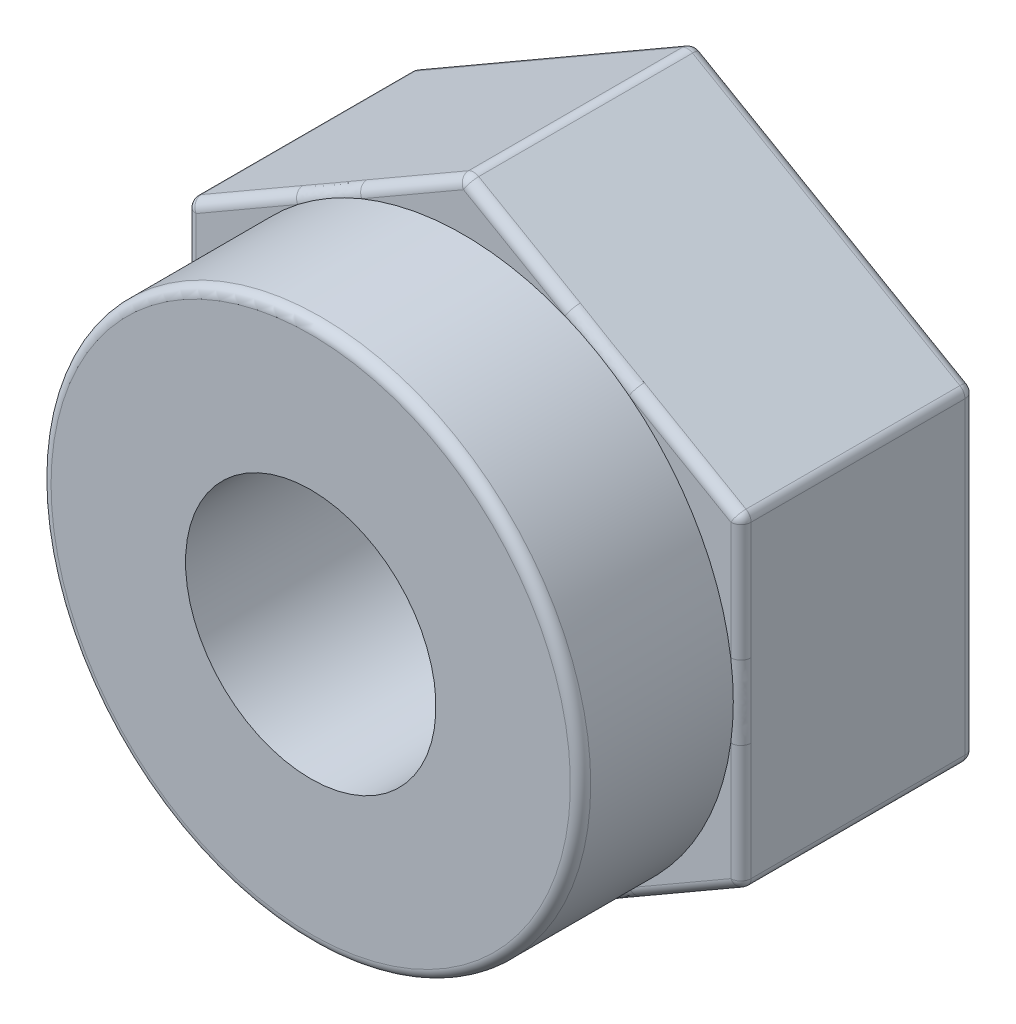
ISO-10303-21;
HEADER;
FILE_DESCRIPTION(('STEP AP214'),'2;1');
FILE_NAME('part.step','',(''),(''),'','','');
FILE_SCHEMA(('AUTOMOTIVE_DESIGN { 1 0 10303 214 1 1 1 1 }'));
ENDSEC;
DATA;
#1=APPLICATION_CONTEXT('core data for automotive mechanical design processes');
#2=APPLICATION_PROTOCOL_DEFINITION('international standard','automotive_design',2000,#1);
#3=PRODUCT_CONTEXT('',#1,'mechanical');
#4=PRODUCT('Part','Part','',(#3));
#5=PRODUCT_RELATED_PRODUCT_CATEGORY('part','',(#4));
#6=PRODUCT_DEFINITION_FORMATION('','',#4);
#7=PRODUCT_DEFINITION_CONTEXT('part definition',#1,'design');
#8=PRODUCT_DEFINITION('design','',#6,#7);
#9=PRODUCT_DEFINITION_SHAPE('','',#8);
#10=(LENGTH_UNIT() NAMED_UNIT(*) SI_UNIT(.MILLI.,.METRE.));
#11=(NAMED_UNIT(*) PLANE_ANGLE_UNIT() SI_UNIT($,.RADIAN.));
#12=(NAMED_UNIT(*) SI_UNIT($,.STERADIAN.) SOLID_ANGLE_UNIT());
#13=UNCERTAINTY_MEASURE_WITH_UNIT(LENGTH_MEASURE(1.E-05),#10,'distance_accuracy_value','');
#14=(GEOMETRIC_REPRESENTATION_CONTEXT(3) GLOBAL_UNCERTAINTY_ASSIGNED_CONTEXT((#13)) GLOBAL_UNIT_ASSIGNED_CONTEXT((#10,
#11,#12)) REPRESENTATION_CONTEXT('',''));
#15=CARTESIAN_POINT('',(0.,0.,0.));
#16=DIRECTION('',(0.,0.,1.));
#17=DIRECTION('',(1.,0.,0.));
#18=AXIS2_PLACEMENT_3D('',#15,#16,#17);
#19=CARTESIAN_POINT('',(0.,0.,2.3));
#20=DIRECTION('',(0.,0.,1.));
#21=DIRECTION('',(1.,0.,0.));
#22=AXIS2_PLACEMENT_3D('',#19,#20,#21);
#23=PLANE('',#22);
#24=CARTESIAN_POINT('',(0.,0.,2.3));
#25=DIRECTION('',(0.,0.,-1.));
#26=DIRECTION('',(0.86602540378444,-0.5,0.));
#27=AXIS2_PLACEMENT_3D('',#24,#25,#26);
#28=CIRCLE('',#27,2.65);
#29=CARTESIAN_POINT('',(-0.998006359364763,2.45488967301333,2.3));
#30=VERTEX_POINT('',#29);
#31=CARTESIAN_POINT('',(0.99800635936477,2.45488967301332,2.3));
#32=VERTEX_POINT('',#31);
#33=EDGE_CURVE('E1821',#30,#32,#28,.T.);
#34=ORIENTED_EDGE('',*,*,#33,.T.);
#35=DIRECTION('',(-0.866025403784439,0.5,0.));
#36=VECTOR('',#35,1.);
#37=CARTESIAN_POINT('',(-0.05,3.05995642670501,2.3));
#38=LINE('',#37,#36);
#39=CARTESIAN_POINT('',(0.,3.03108891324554,2.3));
#40=VERTEX_POINT('',#39);
#41=EDGE_CURVE('E1691',#32,#40,#38,.T.);
#42=ORIENTED_EDGE('',*,*,#41,.T.);
#43=DIRECTION('',(-0.866025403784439,-0.5,0.));
#44=VECTOR('',#43,1.);
#45=CARTESIAN_POINT('',(-2.675,1.48667694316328,2.3));
#46=LINE('',#45,#44);
#47=EDGE_CURVE('E1689',#40,#30,#46,.T.);
#48=ORIENTED_EDGE('',*,*,#47,.T.);
#49=EDGE_LOOP('',(#34,#42,#48));
#50=FACE_BOUND('',#49,.T.);
#51=ADVANCED_FACE('F17',(#50),#23,.T.);
#52=DIRECTION('',(0.,1.,0.));
#53=VECTOR('',#52,1.);
#54=CARTESIAN_POINT('',(2.625,1.57327948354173,2.3));
#55=LINE('',#54,#53);
#56=CARTESIAN_POINT('',(2.625,0.363145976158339,2.3));
#57=VERTEX_POINT('',#56);
#58=CARTESIAN_POINT('',(2.625,1.51554445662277,2.3));
#59=VERTEX_POINT('',#58);
#60=EDGE_CURVE('E1679',#57,#59,#55,.T.);
#61=ORIENTED_EDGE('',*,*,#60,.T.);
#62=DIRECTION('',(-0.866025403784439,0.5,0.));
#63=VECTOR('',#62,1.);
#64=CARTESIAN_POINT('',(-0.05,3.05995642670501,2.3));
#65=LINE('',#64,#63);
#66=CARTESIAN_POINT('',(1.62699364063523,2.09174369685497,2.3));
#67=VERTEX_POINT('',#66);
#68=EDGE_CURVE('E1681',#59,#67,#65,.T.);
#69=ORIENTED_EDGE('',*,*,#68,.T.);
#70=EDGE_CURVE('E1815',#67,#57,#28,.T.);
#71=ORIENTED_EDGE('',*,*,#70,.T.);
#72=EDGE_LOOP('',(#61,#69,#71));
#73=FACE_BOUND('',#72,.T.);
#74=ADVANCED_FACE('F560',(#73),#23,.T.);
#75=CARTESIAN_POINT('',(-2.625,0.363145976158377,2.3));
#76=VERTEX_POINT('',#75);
#77=CARTESIAN_POINT('',(-1.62699364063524,2.09174369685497,2.3));
#78=VERTEX_POINT('',#77);
#79=EDGE_CURVE('E1672',#76,#78,#28,.T.);
#80=ORIENTED_EDGE('',*,*,#79,.T.);
#81=DIRECTION('',(-0.866025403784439,-0.5,0.));
#82=VECTOR('',#81,1.);
#83=CARTESIAN_POINT('',(-2.675,1.48667694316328,2.3));
#84=LINE('',#83,#82);
#85=CARTESIAN_POINT('',(-2.625,1.51554445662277,2.3));
#86=VERTEX_POINT('',#85);
#87=EDGE_CURVE('E1674',#78,#86,#84,.T.);
#88=ORIENTED_EDGE('',*,*,#87,.T.);
#89=DIRECTION('',(0.,-1.,0.));
#90=VECTOR('',#89,1.);
#91=CARTESIAN_POINT('',(-2.625,-1.57327948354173,2.3));
#92=LINE('',#91,#90);
#93=EDGE_CURVE('E1676',#86,#76,#92,.T.);
#94=ORIENTED_EDGE('',*,*,#93,.T.);
#95=EDGE_LOOP('',(#80,#88,#94));
#96=FACE_BOUND('',#95,.T.);
#97=ADVANCED_FACE('F567',(#96),#23,.T.);
#98=DIRECTION('',(0.866025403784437,0.5,0.));
#99=VECTOR('',#98,1.);
#100=CARTESIAN_POINT('',(2.675,-1.48667694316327,2.3));
#101=LINE('',#100,#99);
#102=CARTESIAN_POINT('',(1.62699364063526,-2.09174369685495,2.3));
#103=VERTEX_POINT('',#102);
#104=CARTESIAN_POINT('',(2.625,-1.51554445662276,2.3));
#105=VERTEX_POINT('',#104);
#106=EDGE_CURVE('E614',#103,#105,#101,.T.);
#107=ORIENTED_EDGE('',*,*,#106,.T.);
#108=DIRECTION('',(0.,1.,0.));
#109=VECTOR('',#108,1.);
#110=CARTESIAN_POINT('',(2.625,1.57327948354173,2.3));
#111=LINE('',#110,#109);
#112=CARTESIAN_POINT('',(2.625,-0.363145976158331,2.3));
#113=VERTEX_POINT('',#112);
#114=EDGE_CURVE('E1683',#105,#113,#111,.T.);
#115=ORIENTED_EDGE('',*,*,#114,.T.);
#116=EDGE_CURVE('E738',#113,#103,#28,.T.);
#117=ORIENTED_EDGE('',*,*,#116,.T.);
#118=EDGE_LOOP('',(#107,#115,#117));
#119=FACE_BOUND('',#118,.T.);
#120=ADVANCED_FACE('F583',(#119),#23,.T.);
#121=CARTESIAN_POINT('',(-1.62699364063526,-2.09174369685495,2.3));
#122=VERTEX_POINT('',#121);
#123=CARTESIAN_POINT('',(-2.625,-0.363145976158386,2.3));
#124=VERTEX_POINT('',#123);
#125=EDGE_CURVE('E594',#122,#124,#28,.T.);
#126=ORIENTED_EDGE('',*,*,#125,.T.);
#127=DIRECTION('',(0.,-1.,0.));
#128=VECTOR('',#127,1.);
#129=CARTESIAN_POINT('',(-2.625,-1.57327948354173,2.3));
#130=LINE('',#129,#128);
#131=CARTESIAN_POINT('',(-2.625,-1.51554445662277,2.3));
#132=VERTEX_POINT('',#131);
#133=EDGE_CURVE('E596',#124,#132,#130,.T.);
#134=ORIENTED_EDGE('',*,*,#133,.T.);
#135=DIRECTION('',(0.86602540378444,-0.5,0.));
#136=VECTOR('',#135,1.);
#137=CARTESIAN_POINT('',(0.0500000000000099,-3.05995642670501,2.3));
#138=LINE('',#137,#136);
#139=EDGE_CURVE('E598',#132,#122,#138,.T.);
#140=ORIENTED_EDGE('',*,*,#139,.T.);
#141=EDGE_LOOP('',(#126,#134,#140));
#142=FACE_BOUND('',#141,.T.);
#143=ADVANCED_FACE('F574',(#142),#23,.T.);
#144=CARTESIAN_POINT('',(-2.725,1.57327948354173,2.3));
#145=DIRECTION('',(1.,0.,0.));
#146=DIRECTION('',(0.,1.,0.));
#147=AXIS2_PLACEMENT_3D('',#144,#145,#146);
#148=PLANE('',#147);
#149=DIRECTION('',(0.,-1.,0.));
#150=VECTOR('',#149,1.);
#151=CARTESIAN_POINT('',(-2.725,1.57327948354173,2.2));
#152=LINE('',#151,#150);
#153=CARTESIAN_POINT('',(-2.725,0.363145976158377,2.2));
#154=VERTEX_POINT('',#153);
#155=CARTESIAN_POINT('',(-2.725,1.51554445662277,2.2));
#156=VERTEX_POINT('',#155);
#157=EDGE_CURVE('E1715',#154,#156,#152,.F.);
#158=ORIENTED_EDGE('',*,*,#157,.T.);
#159=DIRECTION('',(0.,0.,-1.));
#160=VECTOR('',#159,1.);
#161=CARTESIAN_POINT('',(-2.725,1.51554445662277,2.3));
#162=LINE('',#161,#160);
#163=CARTESIAN_POINT('',(-2.725,1.51554445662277,0.1));
#164=VERTEX_POINT('',#163);
#165=EDGE_CURVE('E1722',#156,#164,#162,.T.);
#166=ORIENTED_EDGE('',*,*,#165,.T.);
#167=DIRECTION('',(0.,-1.,0.));
#168=VECTOR('',#167,1.);
#169=CARTESIAN_POINT('',(-2.725,1.57327948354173,0.1));
#170=LINE('',#169,#168);
#171=CARTESIAN_POINT('',(-2.725,-1.51554445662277,0.1));
#172=VERTEX_POINT('',#171);
#173=EDGE_CURVE('E1720',#164,#172,#170,.T.);
#174=ORIENTED_EDGE('',*,*,#173,.T.);
#175=DIRECTION('',(0.,0.,-1.));
#176=VECTOR('',#175,1.);
#177=CARTESIAN_POINT('',(-2.725,-1.51554445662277,2.3));
#178=LINE('',#177,#176);
#179=CARTESIAN_POINT('',(-2.725,-1.51554445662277,2.2));
#180=VERTEX_POINT('',#179);
#181=EDGE_CURVE('E1718',#172,#180,#178,.F.);
#182=ORIENTED_EDGE('',*,*,#181,.T.);
#183=DIRECTION('',(0.,-1.,0.));
#184=VECTOR('',#183,1.);
#185=CARTESIAN_POINT('',(-2.725,1.57327948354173,2.2));
#186=LINE('',#185,#184);
#187=CARTESIAN_POINT('',(-2.725,-0.363145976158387,2.2));
#188=VERTEX_POINT('',#187);
#189=EDGE_CURVE('E1714',#180,#188,#186,.F.);
#190=ORIENTED_EDGE('',*,*,#189,.T.);
#191=CARTESIAN_POINT('',(-2.725,0.464201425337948,2.20124466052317));
#192=CARTESIAN_POINT('',(-2.725,0.460960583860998,2.31809843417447));
#193=CARTESIAN_POINT('',(-2.60951189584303,0.461462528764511,2.3));
#194=CARTESIAN_POINT('',(-2.725,0.420825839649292,2.20011941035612));
#195=CARTESIAN_POINT('',(-2.725,0.421168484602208,2.30851697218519));
#196=CARTESIAN_POINT('',(-2.61691288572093,0.419655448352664,2.3));
#197=CARTESIAN_POINT('',(-2.725,0.377450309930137,2.19988224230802));
#198=CARTESIAN_POINT('',(-2.725,0.378422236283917,2.30152091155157));
#199=CARTESIAN_POINT('',(-2.62335828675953,0.37730515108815,2.3));
#200=CARTESIAN_POINT('',(-2.725,0.290701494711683,2.20026426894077));
#201=CARTESIAN_POINT('',(-2.725,0.292908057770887,2.29143454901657));
#202=CARTESIAN_POINT('',(-2.63423440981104,0.291812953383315,2.3));
#203=CARTESIAN_POINT('',(-2.725,0.24732820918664,2.20088343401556));
#204=CARTESIAN_POINT('',(-2.725,0.249166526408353,2.28803299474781));
#205=CARTESIAN_POINT('',(-2.63866520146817,0.248671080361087,2.3));
#206=CARTESIAN_POINT('',(-2.725,0.160584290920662,2.20205835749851));
#207=CARTESIAN_POINT('',(-2.725,0.162257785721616,2.28334856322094));
#208=CARTESIAN_POINT('',(-2.6454090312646,0.161888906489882,2.3));
#209=CARTESIAN_POINT('',(-2.725,0.117213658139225,2.20261411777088));
#210=CARTESIAN_POINT('',(-2.725,0.118267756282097,2.28196264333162));
#211=CARTESIAN_POINT('',(-2.64772213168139,0.118248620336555,2.3));
#212=CARTESIAN_POINT('',(-2.725,0.0304689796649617,2.20321234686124));
#213=CARTESIAN_POINT('',(-2.725,0.0309358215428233,2.28052298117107));
#214=CARTESIAN_POINT('',(-2.65018217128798,0.0307815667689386,2.3));
#215=CARTESIAN_POINT('',(-2.725,-0.0129050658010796,2.20325483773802));
#216=CARTESIAN_POINT('',(-2.725,-0.0131744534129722,2.28044346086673));
#217=CARTESIAN_POINT('',(-2.65032920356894,-0.0130451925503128,2.3));
#218=CARTESIAN_POINT('',(-2.725,-0.0996500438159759,2.20278850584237));
#219=CARTESIAN_POINT('',(-2.725,-0.100550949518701,2.28152872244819));
#220=CARTESIAN_POINT('',(-2.64845318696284,-0.100555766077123,2.3));
#221=CARTESIAN_POINT('',(-2.725,-0.143020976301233,2.20227967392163));
#222=CARTESIAN_POINT('',(-2.725,-0.144580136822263,2.28271258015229));
#223=CARTESIAN_POINT('',(-2.64643010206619,-0.144239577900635,2.3));
#224=CARTESIAN_POINT('',(-2.725,-0.229755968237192,2.20113172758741));
#225=CARTESIAN_POINT('',(-2.725,-0.231531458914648,2.28686800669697));
#226=CARTESIAN_POINT('',(-2.6402596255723,-0.231142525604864,2.3));
#227=CARTESIAN_POINT('',(-2.725,-0.273120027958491,2.20049262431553));
#228=CARTESIAN_POINT('',(-2.725,-0.275268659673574,2.28992786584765));
#229=CARTESIAN_POINT('',(-2.63611241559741,-0.274361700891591,2.3));
#230=CARTESIAN_POINT('',(-2.725,-0.359879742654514,2.19986631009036));
#231=CARTESIAN_POINT('',(-2.725,-0.361178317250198,2.29909218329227));
#232=CARTESIAN_POINT('',(-2.62577832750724,-0.360071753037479,2.3));
#233=CARTESIAN_POINT('',(-2.725,-0.403275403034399,2.19987939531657));
#234=CARTESIAN_POINT('',(-2.725,-0.404289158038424,2.30546391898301));
#235=CARTESIAN_POINT('',(-2.61959052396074,-0.402562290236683,2.3));
#236=CARTESIAN_POINT('',(-2.725,-0.468362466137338,2.20128084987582));
#237=CARTESIAN_POINT('',(-2.725,-0.465440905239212,2.31889477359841));
#238=CARTESIAN_POINT('',(-2.60887888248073,-0.465515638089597,2.3));
#239=CARTESIAN_POINT('',(-2.725,-0.490064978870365,2.20197881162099));
#240=CARTESIAN_POINT('',(-2.725,-0.486075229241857,2.32429652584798));
#241=CARTESIAN_POINT('',(-2.60506836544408,-0.48637712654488,2.3));
#242=CARTESIAN_POINT('',(-2.725,-0.533445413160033,2.20407583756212));
#243=CARTESIAN_POINT('',(-2.725,-0.526209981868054,2.33718442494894));
#244=CARTESIAN_POINT('',(-2.59699557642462,-0.527787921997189,2.3));
#245=CARTESIAN_POINT('',(-2.725,-0.555123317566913,2.2054752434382));
#246=CARTESIAN_POINT('',(-2.725,-0.545862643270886,2.34485854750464));
#247=CARTESIAN_POINT('',(-2.59273308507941,-0.548337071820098,2.3));
#248=CARTESIAN_POINT('',(-2.725,-0.576769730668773,2.20734517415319));
#249=CARTESIAN_POINT('',(-2.725,-0.56400814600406,2.35381454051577));
#250=CARTESIAN_POINT('',(-2.58825884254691,-0.568696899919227,2.3));
#251=(BOUNDED_SURFACE() B_SPLINE_SURFACE(3,2,((#191,#192,#193),(#194,#195,#196),(#197,#198,
#199),(#200,#201,#202),(#203,#204,#205),(#206,#207,#208),(#209,#210,#211),(#212,#213,#214),
(#215,#216,#217),(#218,#219,#220),(#221,#222,#223),(#224,#225,#226),(#227,#228,#229),(#230,#231,
#232),(#233,#234,#235),(#236,#237,#238),(#239,#240,#241),(#242,#243,#244),(#245,#246,#247),
(#248,#249,#250)),.UNSPECIFIED.,.F.,.F.,.F.) B_SPLINE_SURFACE_WITH_KNOTS((4,2,2,2,2,2,2,2,2,4),
(3,3),(0.,0.130131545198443,0.260258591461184,0.390381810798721,0.520499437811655,
0.650619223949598,0.78072788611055,0.910895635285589,0.976026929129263,1.04118997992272),(0.,
1.),.UNSPECIFIED.) GEOMETRIC_REPRESENTATION_ITEM() RATIONAL_B_SPLINE_SURFACE(((1.,
0.650045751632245,1.),(1.,0.678237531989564,1.),(1.,0.701469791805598,1.),(1.,0.739337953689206,
1.),(1.,0.753974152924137,1.),(1.,0.775974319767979,1.),(1.,0.783338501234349,1.),(1.,
0.791159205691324,1.),(1.,0.791616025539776,1.),(1.,0.785667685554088,1.),(1.,0.779262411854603,
1.),(1.,0.759209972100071,1.),(1.,0.745563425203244,1.),(1.,0.710083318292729,1.),(1.,
0.688246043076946,1.),(1.,0.647746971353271,1.),(1.,0.63294995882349,1.),(1.,0.600192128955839,
1.),(1.,0.582229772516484,1.),(1.,0.562400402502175,1.))) REPRESENTATION_ITEM('') SURFACE());
#252=CARTESIAN_POINT('',(-2.725,-0.576769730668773,2.20734517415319));
#253=CARTESIAN_POINT('',(-2.725,-0.555123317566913,2.2054752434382));
#254=CARTESIAN_POINT('',(-2.725,-0.533445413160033,2.20407583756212));
#255=CARTESIAN_POINT('',(-2.725,-0.490064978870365,2.20197881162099));
#256=CARTESIAN_POINT('',(-2.725,-0.468362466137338,2.20128084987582));
#257=CARTESIAN_POINT('',(-2.725,-0.403275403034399,2.19987939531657));
#258=CARTESIAN_POINT('',(-2.725,-0.359879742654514,2.19986631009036));
#259=CARTESIAN_POINT('',(-2.725,-0.273120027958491,2.20049262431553));
#260=CARTESIAN_POINT('',(-2.725,-0.229755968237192,2.20113172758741));
#261=CARTESIAN_POINT('',(-2.725,-0.143020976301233,2.20227967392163));
#262=CARTESIAN_POINT('',(-2.725,-0.0996500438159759,2.20278850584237));
#263=CARTESIAN_POINT('',(-2.725,-0.0129050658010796,2.20325483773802));
#264=CARTESIAN_POINT('',(-2.725,0.0304689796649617,2.20321234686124));
#265=CARTESIAN_POINT('',(-2.725,0.117213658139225,2.20261411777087));
#266=CARTESIAN_POINT('',(-2.725,0.160584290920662,2.20205835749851));
#267=CARTESIAN_POINT('',(-2.725,0.24732820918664,2.20088343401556));
#268=CARTESIAN_POINT('',(-2.725,0.290701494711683,2.20026426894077));
#269=CARTESIAN_POINT('',(-2.725,0.377450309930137,2.19988224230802));
#270=CARTESIAN_POINT('',(-2.725,0.420825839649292,2.20011941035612));
#271=CARTESIAN_POINT('',(-2.725,0.464201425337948,2.20124466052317));
#272=B_SPLINE_CURVE_WITH_KNOTS('',3,(#252,#253,#254,#255,#256,#257,#258,#259,#260,#261,#262,
#263,#264,#265,#266,#267,#268,#269,#270,#271),.UNSPECIFIED.,.F.,.F.,(4,2,2,2,2,2,2,2,2,4),(0.,
0.065163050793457,0.130294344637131,0.26046209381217,0.390570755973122,0.520690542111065,
0.650808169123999,0.780931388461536,0.911058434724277,1.04118997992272),.UNSPECIFIED.);
#273=EDGE_CURVE('E619',#188,#154,#272,.T.);
#274=ORIENTED_EDGE('',*,*,#273,.T.);
#275=EDGE_LOOP('',(#158,#166,#174,#182,#190,#274));
#276=FACE_BOUND('',#275,.T.);
#277=ADVANCED_FACE('F433',(#276),#148,.F.);
#278=CARTESIAN_POINT('',(-2.725,-1.57327948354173,2.3));
#279=DIRECTION('',(0.5,0.86602540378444,0.));
#280=DIRECTION('',(-0.86602540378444,0.5,0.));
#281=AXIS2_PLACEMENT_3D('',#278,#279,#280);
#282=PLANE('',#281);
#283=DIRECTION('',(0.86602540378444,-0.5,0.));
#284=VECTOR('',#283,1.);
#285=CARTESIAN_POINT('',(-2.725,-1.57327948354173,2.2));
#286=LINE('',#285,#284);
#287=CARTESIAN_POINT('',(-0.0499999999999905,-3.11769145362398,2.2));
#288=VERTEX_POINT('',#287);
#289=CARTESIAN_POINT('',(-1.04800635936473,-2.54149221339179,2.2));
#290=VERTEX_POINT('',#289);
#291=EDGE_CURVE('E1744',#288,#290,#286,.F.);
#292=ORIENTED_EDGE('',*,*,#291,.T.);
#293=CARTESIAN_POINT('',(-1.76451022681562,-2.12781851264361,2.20124466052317));
#294=CARTESIAN_POINT('',(-1.76170357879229,-2.1294389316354,2.3180984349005));
#295=CARTESIAN_POINT('',(-1.70439422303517,-2.02917232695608,2.3));
#296=CARTESIAN_POINT('',(-1.72694586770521,-2.14950630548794,2.20011941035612));
#297=CARTESIAN_POINT('',(-1.72724260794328,-2.14933498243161,2.30851697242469));
#298=CARTESIAN_POINT('',(-1.67188872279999,-2.05648531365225,2.3));
#299=CARTESIAN_POINT('',(-1.68938155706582,-2.17119407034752,2.19988224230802));
#300=CARTESIAN_POINT('',(-1.69022327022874,-2.17070810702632,2.30152091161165));
#301=CARTESIAN_POINT('',(-1.6384349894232,-2.08324234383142,2.3));
#302=CARTESIAN_POINT('',(-1.61425487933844,-2.21456847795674,2.20026426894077));
#303=CARTESIAN_POINT('',(-1.61616581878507,-2.21346519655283,2.29143454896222));
#304=CARTESIAN_POINT('',(-1.56983463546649,-2.13540744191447,2.3));
#305=CARTESIAN_POINT('',(-1.57669251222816,-2.23625512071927,2.20088343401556));
#306=CARTESIAN_POINT('',(-1.57828454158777,-2.23533596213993,2.28803299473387));
#307=CARTESIAN_POINT('',(-1.53468807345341,-2.16081555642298,2.3));
#308=CARTESIAN_POINT('',(-1.50157007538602,-2.27962707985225,2.20205835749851));
#309=CARTESIAN_POINT('',(-1.5030193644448,-2.27879033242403,2.28334856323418));
#310=CARTESIAN_POINT('',(-1.46290442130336,-2.21004697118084,2.3));
#311=CARTESIAN_POINT('',(-1.46401000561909,-2.30131239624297,2.20261411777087));
#312=CARTESIAN_POINT('',(-1.46492288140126,-2.3007853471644,2.28196264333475));
#313=CARTESIAN_POINT('',(-1.42626737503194,-2.23387031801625,2.3));
#314=CARTESIAN_POINT('',(-1.38888691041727,-2.3446847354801,2.20321234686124));
#315=CARTESIAN_POINT('',(-1.38929120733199,-2.34445131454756,2.28052298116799));
#316=CARTESIAN_POINT('',(-1.35174870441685,-2.27973430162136,2.3));
#317=CARTESIAN_POINT('',(-1.35132388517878,-2.36637175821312,2.20325483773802));
#318=CARTESIAN_POINT('',(-1.35109058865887,-2.36650645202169,2.28044346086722));
#319=CARTESIAN_POINT('',(-1.31386713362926,-2.30177501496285,2.3));
#320=CARTESIAN_POINT('',(-1.27620053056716,-2.40974424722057,2.20278850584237));
#321=CARTESIAN_POINT('',(-1.27542032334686,-2.41019470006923,2.28152872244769));
#322=CARTESIAN_POINT('',(-1.23714274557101,-2.34390562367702,2.3));
#323=CARTESIAN_POINT('',(-1.23864020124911,-2.4314297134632,2.20227967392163));
#324=CARTESIAN_POINT('',(-1.23728992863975,-2.43220929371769,2.28271258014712));
#325=CARTESIAN_POINT('',(-1.19829991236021,-2.36399548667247,2.3));
#326=CARTESIAN_POINT('',(-1.16352549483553,-2.47479720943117,2.20113172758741));
#327=CARTESIAN_POINT('',(-1.1619878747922,-2.4756849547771,2.28686800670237));
#328=CARTESIAN_POINT('',(-1.11995451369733,-2.4021031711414,2.3));
#329=CARTESIAN_POINT('',(-1.12597111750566,-2.49647923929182,2.20049262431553));
#330=CARTESIAN_POINT('',(-1.12411034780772,-2.49755355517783,2.28992786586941));
#331=CARTESIAN_POINT('',(-1.08045200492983,-2.42012116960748,2.3));
#332=CARTESIAN_POINT('',(-1.05083500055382,-2.53985909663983,2.19986631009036));
#333=CARTESIAN_POINT('',(-1.04971040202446,-2.54050838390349,2.29909218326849));
#334=CARTESIAN_POINT('',(-1.00105787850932,-2.45402661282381,2.3));
#335=CARTESIAN_POINT('',(-1.01325325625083,-2.56155692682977,2.19987939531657));
#336=CARTESIAN_POINT('',(-1.01237531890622,-2.56206380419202,2.30546391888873));
#337=CARTESIAN_POINT('',(-0.961166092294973,-2.46991308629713,2.3));
#338=CARTESIAN_POINT('',(-0.956886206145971,-2.59410045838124,2.20128084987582));
#339=CARTESIAN_POINT('',(-0.95941635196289,-2.59263967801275,2.31889477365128));
#340=CARTESIAN_POINT('',(-0.901291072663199,-2.49211320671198,2.3));
#341=CARTESIAN_POINT('',(-0.938091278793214,-2.60495171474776,2.20197881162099));
#342=CARTESIAN_POINT('',(-0.941546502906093,-2.60295684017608,2.32429652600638));
#343=CARTESIAN_POINT('',(-0.881319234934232,-2.49924394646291,2.3));
#344=CARTESIAN_POINT('',(-0.900522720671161,-2.62664193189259,2.20407583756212));
#345=CARTESIAN_POINT('',(-0.906788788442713,-2.62302421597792,2.33718442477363));
#346=CARTESIAN_POINT('',(-0.841420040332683,-2.51295810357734,2.3));
#347=CARTESIAN_POINT('',(-0.881749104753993,-2.63748088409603,2.20547524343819));
#348=CARTESIAN_POINT('',(-0.889769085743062,-2.63285054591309,2.34485854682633));
#349=CARTESIAN_POINT('',(-0.821492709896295,-2.5195412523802,2.3));
#350=CARTESIAN_POINT('',(-0.863002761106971,-2.64830409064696,2.20734517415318));
#351=CARTESIAN_POINT('',(-0.874054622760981,-2.64192329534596,2.35381453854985));
#352=CARTESIAN_POINT('',(-0.801623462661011,-2.52584635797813,2.3));
#353=(BOUNDED_SURFACE() B_SPLINE_SURFACE(3,2,((#293,#294,#295),(#296,#297,#298),(#299,#300,
#301),(#302,#303,#304),(#305,#306,#307),(#308,#309,#310),(#311,#312,#313),(#314,#315,#316),
(#317,#318,#319),(#320,#321,#322),(#323,#324,#325),(#326,#327,#328),(#329,#330,#331),(#332,#333,
#334),(#335,#336,#337),(#338,#339,#340),(#341,#342,#343),(#344,#345,#346),(#347,#348,#349),
(#350,#351,#352)),.UNSPECIFIED.,.F.,.F.,.F.) B_SPLINE_SURFACE_WITH_KNOTS((4,2,2,2,2,2,2,2,2,4),
(3,3),(0.,0.130131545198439,0.260258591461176,0.390381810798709,0.52049943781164,
0.650619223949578,0.780727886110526,0.910895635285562,0.976026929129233,1.04118997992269),(0.,
1.),.UNSPECIFIED.) GEOMETRIC_REPRESENTATION_ITEM() RATIONAL_B_SPLINE_SURFACE(((1.,
0.650045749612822,1.),(1.,0.678237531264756,1.),(1.,0.701469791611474,1.),(1.,0.739337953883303,
1.),(1.,0.753974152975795,1.),(1.,0.775974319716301,1.),(1.,0.783338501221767,1.),(1.,
0.791159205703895,1.),(1.,0.791616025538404,1.),(1.,0.785667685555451,1.),(1.,0.779262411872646,
1.),(1.,0.75920997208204,1.),(1.,0.745563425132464,1.),(1.,0.710083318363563,1.),(1.,
0.688246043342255,1.),(1.,0.647746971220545,1.),(1.,0.632949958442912,1.),(1.,0.600192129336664,
1.),(1.,0.582229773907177,1.),(1.,0.562400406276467,1.))) REPRESENTATION_ITEM('') SURFACE());
#354=CARTESIAN_POINT('',(-0.863002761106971,-2.64830409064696,2.20734517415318));
#355=CARTESIAN_POINT('',(-0.881749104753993,-2.63748088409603,2.20547524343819));
#356=CARTESIAN_POINT('',(-0.900522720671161,-2.62664193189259,2.20407583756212));
#357=CARTESIAN_POINT('',(-0.938091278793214,-2.60495171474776,2.20197881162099));
#358=CARTESIAN_POINT('',(-0.956886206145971,-2.59410045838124,2.20128084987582));
#359=CARTESIAN_POINT('',(-1.01325325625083,-2.56155692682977,2.19987939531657));
#360=CARTESIAN_POINT('',(-1.05083500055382,-2.53985909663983,2.19986631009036));
#361=CARTESIAN_POINT('',(-1.12597111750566,-2.49647923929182,2.20049262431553));
#362=CARTESIAN_POINT('',(-1.16352549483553,-2.47479720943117,2.20113172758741));
#363=CARTESIAN_POINT('',(-1.23864020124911,-2.4314297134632,2.20227967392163));
#364=CARTESIAN_POINT('',(-1.27620053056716,-2.40974424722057,2.20278850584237));
#365=CARTESIAN_POINT('',(-1.35132388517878,-2.36637175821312,2.20325483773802));
#366=CARTESIAN_POINT('',(-1.38888691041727,-2.3446847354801,2.20321234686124));
#367=CARTESIAN_POINT('',(-1.46401000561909,-2.30131239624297,2.20261411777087));
#368=CARTESIAN_POINT('',(-1.50157007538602,-2.27962707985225,2.20205835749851));
#369=CARTESIAN_POINT('',(-1.57669251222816,-2.23625512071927,2.20088343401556));
#370=CARTESIAN_POINT('',(-1.61425487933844,-2.21456847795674,2.20026426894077));
#371=CARTESIAN_POINT('',(-1.68938155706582,-2.17119407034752,2.19988224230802));
#372=CARTESIAN_POINT('',(-1.72694586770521,-2.14950630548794,2.20011941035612));
#373=CARTESIAN_POINT('',(-1.76451022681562,-2.12781851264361,2.20124466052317));
#374=B_SPLINE_CURVE_WITH_KNOTS('',3,(#354,#355,#356,#357,#358,#359,#360,#361,#362,#363,#364,
#365,#366,#367,#368,#369,#370,#371,#372,#373),.UNSPECIFIED.,.F.,.F.,(4,2,2,2,2,2,2,2,2,4),(0.,
0.0651630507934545,0.130294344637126,0.260462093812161,0.390570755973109,0.520690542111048,
0.650808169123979,0.780931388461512,0.911058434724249,1.04118997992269),.UNSPECIFIED.);
#375=CARTESIAN_POINT('',(-1.67699364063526,-2.1783462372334,2.2));
#376=VERTEX_POINT('',#375);
#377=EDGE_CURVE('E11',#290,#376,#374,.T.);
#378=ORIENTED_EDGE('',*,*,#377,.T.);
#379=DIRECTION('',(0.86602540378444,-0.5,0.));
#380=VECTOR('',#379,1.);
#381=CARTESIAN_POINT('',(-2.725,-1.57327948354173,2.2));
#382=LINE('',#381,#380);
#383=CARTESIAN_POINT('',(-2.675,-1.60214699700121,2.2));
#384=VERTEX_POINT('',#383);
#385=EDGE_CURVE('E32',#376,#384,#382,.F.);
#386=ORIENTED_EDGE('',*,*,#385,.T.);
#387=DIRECTION('',(0.,0.,-1.));
#388=VECTOR('',#387,1.);
#389=CARTESIAN_POINT('',(-2.675,-1.60214699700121,2.3));
#390=LINE('',#389,#388);
#391=CARTESIAN_POINT('',(-2.675,-1.60214699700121,0.1));
#392=VERTEX_POINT('',#391);
#393=EDGE_CURVE('E1747',#384,#392,#390,.T.);
#394=ORIENTED_EDGE('',*,*,#393,.T.);
#395=DIRECTION('',(0.86602540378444,-0.5,0.));
#396=VECTOR('',#395,1.);
#397=CARTESIAN_POINT('',(-2.725,-1.57327948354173,0.1));
#398=LINE('',#397,#396);
#399=CARTESIAN_POINT('',(-0.0499999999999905,-3.11769145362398,0.1));
#400=VERTEX_POINT('',#399);
#401=EDGE_CURVE('E1746',#392,#400,#398,.T.);
#402=ORIENTED_EDGE('',*,*,#401,.T.);
#403=DIRECTION('',(0.,0.,-1.));
#404=VECTOR('',#403,1.);
#405=CARTESIAN_POINT('',(-0.0499999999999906,-3.11769145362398,2.3));
#406=LINE('',#405,#404);
#407=EDGE_CURVE('E1742',#400,#288,#406,.F.);
#408=ORIENTED_EDGE('',*,*,#407,.T.);
#409=EDGE_LOOP('',(#292,#378,#386,#394,#402,#408));
#410=FACE_BOUND('',#409,.T.);
#411=ADVANCED_FACE('F507',(#410),#282,.F.);
#412=CARTESIAN_POINT('',(0.,-3.14655896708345,2.3));
#413=DIRECTION('',(-0.5,0.866025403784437,0.));
#414=DIRECTION('',(-0.866025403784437,-0.5,0.));
#415=AXIS2_PLACEMENT_3D('',#412,#413,#414);
#416=PLANE('',#415);
#417=DIRECTION('',(0.866025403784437,0.5,0.));
#418=VECTOR('',#417,1.);
#419=CARTESIAN_POINT('',(0.,-3.14655896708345,0.1));
#420=LINE('',#419,#418);
#421=CARTESIAN_POINT('',(0.05000000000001,-3.11769145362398,0.1));
#422=VERTEX_POINT('',#421);
#423=CARTESIAN_POINT('',(2.675,-1.6021469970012,0.1));
#424=VERTEX_POINT('',#423);
#425=EDGE_CURVE('E1737',#422,#424,#420,.T.);
#426=ORIENTED_EDGE('',*,*,#425,.T.);
#427=DIRECTION('',(0.,0.,-1.));
#428=VECTOR('',#427,1.);
#429=CARTESIAN_POINT('',(2.675,-1.6021469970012,2.3));
#430=LINE('',#429,#428);
#431=CARTESIAN_POINT('',(2.675,-1.6021469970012,2.2));
#432=VERTEX_POINT('',#431);
#433=EDGE_CURVE('E1739',#424,#432,#430,.F.);
#434=ORIENTED_EDGE('',*,*,#433,.T.);
#435=DIRECTION('',(0.866025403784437,0.5,0.));
#436=VECTOR('',#435,1.);
#437=CARTESIAN_POINT('',(0.,-3.14655896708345,2.2));
#438=LINE('',#437,#436);
#439=CARTESIAN_POINT('',(1.67699364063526,-2.1783462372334,2.2));
#440=VERTEX_POINT('',#439);
#441=EDGE_CURVE('E1735',#432,#440,#438,.F.);
#442=ORIENTED_EDGE('',*,*,#441,.T.);
#443=CARTESIAN_POINT('',(0.960489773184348,-2.59201993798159,2.20124466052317));
#444=CARTESIAN_POINT('',(0.963296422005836,-2.59039951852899,2.31809843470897));
#445=CARTESIAN_POINT('',(0.905117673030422,-2.49063485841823,2.3));
#446=CARTESIAN_POINT('',(0.998054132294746,-2.57033214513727,2.20011941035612));
#447=CARTESIAN_POINT('',(0.997757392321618,-2.57050346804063,2.30851697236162));
#448=CARTESIAN_POINT('',(0.945024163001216,-2.4761407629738,2.3));
#449=CARTESIAN_POINT('',(1.03561844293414,-2.5486443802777,2.19988224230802));
#450=CARTESIAN_POINT('',(1.03477672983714,-2.54913034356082,2.30152091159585));
#451=CARTESIAN_POINT('',(0.984923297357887,-2.46054749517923,2.3));
#452=CARTESIAN_POINT('',(1.11074512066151,-2.50526997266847,2.20026426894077));
#453=CARTESIAN_POINT('',(1.10883418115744,-2.50637325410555,2.29143454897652));
#454=CARTESIAN_POINT('',(1.06439977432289,-2.4272203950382,2.3));
#455=CARTESIAN_POINT('',(1.14830748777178,-2.48358332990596,2.20088343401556));
#456=CARTESIAN_POINT('',(1.14671545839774,-2.48450248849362,2.28803299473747));
#457=CARTESIAN_POINT('',(1.10397712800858,-2.40948663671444,2.3));
#458=CARTESIAN_POINT('',(1.22342992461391,-2.44021137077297,2.20205835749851));
#459=CARTESIAN_POINT('',(1.22198063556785,-2.44104811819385,2.28334856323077));
#460=CARTESIAN_POINT('',(1.18250460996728,-2.37193587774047,2.3));
#461=CARTESIAN_POINT('',(1.26098999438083,-2.41852605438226,2.20261411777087));
#462=CARTESIAN_POINT('',(1.26007711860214,-2.41905310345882,2.2819626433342));
#463=CARTESIAN_POINT('',(1.22145475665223,-2.35211893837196,2.3));
#464=CARTESIAN_POINT('',(1.33611308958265,-2.37515371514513,2.20321234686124));
#465=CARTESIAN_POINT('',(1.3357087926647,-2.37538713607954,2.28052298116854));
#466=CARTESIAN_POINT('',(1.29843346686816,-2.31051586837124,2.3));
#467=CARTESIAN_POINT('',(1.37367611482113,-2.35346669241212,2.20325483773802));
#468=CARTESIAN_POINT('',(1.37390941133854,-2.35333199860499,2.2804434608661));
#469=CARTESIAN_POINT('',(1.33646206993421,-2.28872982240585,2.3));
#470=CARTESIAN_POINT('',(1.44879946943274,-2.31009420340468,2.20278850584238));
#471=CARTESIAN_POINT('',(1.44957967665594,-2.30964375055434,2.28152872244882));
#472=CARTESIAN_POINT('',(1.41131044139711,-2.24334985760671,2.3));
#473=CARTESIAN_POINT('',(1.48635979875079,-2.28840873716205,2.20227967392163));
#474=CARTESIAN_POINT('',(1.48771007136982,-2.28762915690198,2.28271258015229));
#475=CARTESIAN_POINT('',(1.44813018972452,-2.21975590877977,2.3));
#476=CARTESIAN_POINT('',(1.56147450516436,-2.24504124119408,2.20113172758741));
#477=CARTESIAN_POINT('',(1.56301212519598,-2.24415349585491,2.28686800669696));
#478=CARTESIAN_POINT('',(1.52030511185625,-2.17096064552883,2.3));
#479=CARTESIAN_POINT('',(1.59902888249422,-2.22335921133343,2.20049262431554));
#480=CARTESIAN_POINT('',(1.60088965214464,-2.22228489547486,2.28992786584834));
#481=CARTESIAN_POINT('',(1.55566041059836,-2.1457594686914,2.3));
#482=CARTESIAN_POINT('',(1.67416499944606,-2.17997935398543,2.19986631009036));
#483=CARTESIAN_POINT('',(1.67528959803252,-2.1793300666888,2.29909218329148));
#484=CARTESIAN_POINT('',(1.62472044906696,-2.09395485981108,2.3));
#485=CARTESIAN_POINT('',(1.71174674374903,-2.15828152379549,2.19987939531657));
#486=CARTESIAN_POINT('',(1.71262468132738,-2.1577746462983,2.30546391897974));
#487=CARTESIAN_POINT('',(1.6584244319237,-2.06735079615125,2.3));
#488=CARTESIAN_POINT('',(1.76811379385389,-2.12573799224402,2.20128084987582));
#489=CARTESIAN_POINT('',(1.76558364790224,-2.1271987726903,2.31889477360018));
#490=CARTESIAN_POINT('',(1.70758780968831,-2.02659756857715,2.3));
#491=CARTESIAN_POINT('',(1.78690872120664,-2.11488673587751,2.20197881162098));
#492=CARTESIAN_POINT('',(1.78345349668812,-2.11688161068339,2.32429652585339));
#493=CARTESIAN_POINT('',(1.72374913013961,-2.01286681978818,2.3));
#494=CARTESIAN_POINT('',(1.82447727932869,-2.09319651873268,2.20407583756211));
#495=CARTESIAN_POINT('',(1.81821121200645,-2.09681423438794,2.33718442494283));
#496=CARTESIAN_POINT('',(1.75557553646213,-1.98517018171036,2.3));
#497=CARTESIAN_POINT('',(1.84325089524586,-2.08235756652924,2.20547524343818));
#498=CARTESIAN_POINT('',(1.83523091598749,-2.08698790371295,2.34485854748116));
#499=CARTESIAN_POINT('',(1.77124037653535,-1.97120418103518,2.3));
#500=CARTESIAN_POINT('',(1.86199723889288,-2.07153435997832,2.20734517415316));
#501=CARTESIAN_POINT('',(1.85094538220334,-2.07791515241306,2.35381454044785));
#502=CARTESIAN_POINT('',(1.78663538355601,-1.95714945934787,2.3));
#503=(BOUNDED_SURFACE() B_SPLINE_SURFACE(3,2,((#443,#444,#445),(#446,#447,#448),(#449,#450,
#451),(#452,#453,#454),(#455,#456,#457),(#458,#459,#460),(#461,#462,#463),(#464,#465,#466),
(#467,#468,#469),(#470,#471,#472),(#473,#474,#475),(#476,#477,#478),(#479,#480,#481),(#482,#483,
#484),(#485,#486,#487),(#488,#489,#490),(#491,#492,#493),(#494,#495,#496),(#497,#498,#499),
(#500,#501,#502)),.UNSPECIFIED.,.F.,.F.,.F.) B_SPLINE_SURFACE_WITH_KNOTS((4,2,2,2,2,2,2,2,2,4),
(3,3),(0.,0.130131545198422,0.260258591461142,0.390381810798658,0.520499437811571,
0.650619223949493,0.780727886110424,0.910895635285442,0.976026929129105,1.04118997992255),(0.,
1.),.UNSPECIFIED.) GEOMETRIC_REPRESENTATION_ITEM() RATIONAL_B_SPLINE_SURFACE(((1.,
0.650045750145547,1.),(1.,0.67823753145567,1.),(1.,0.701469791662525,1.),(1.,0.739337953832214,
1.),(1.,0.753974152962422,1.),(1.,0.775974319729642,1.),(1.,0.783338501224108,1.),(1.,
0.791159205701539,1.),(1.,0.791616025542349,1.),(1.,0.785667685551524,1.),(1.,0.779262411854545,
1.),(1.,0.759209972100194,1.),(1.,0.745563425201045,1.),(1.,0.71008331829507,1.),(1.,
0.688246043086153,1.),(1.,0.647746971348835,1.),(1.,0.632949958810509,1.),(1.,0.600192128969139,
1.),(1.,0.582229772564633,1.),(1.,0.562400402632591,1.))) REPRESENTATION_ITEM('') SURFACE());
#504=CARTESIAN_POINT('',(1.86199723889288,-2.07153435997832,2.20734517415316));
#505=CARTESIAN_POINT('',(1.84325089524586,-2.08235756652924,2.20547524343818));
#506=CARTESIAN_POINT('',(1.82447727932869,-2.09319651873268,2.20407583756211));
#507=CARTESIAN_POINT('',(1.78690872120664,-2.11488673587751,2.20197881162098));
#508=CARTESIAN_POINT('',(1.76811379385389,-2.12573799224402,2.20128084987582));
#509=CARTESIAN_POINT('',(1.71174674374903,-2.15828152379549,2.19987939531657));
#510=CARTESIAN_POINT('',(1.67416499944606,-2.17997935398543,2.19986631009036));
#511=CARTESIAN_POINT('',(1.59902888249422,-2.22335921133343,2.20049262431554));
#512=CARTESIAN_POINT('',(1.56147450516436,-2.24504124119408,2.20113172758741));
#513=CARTESIAN_POINT('',(1.48635979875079,-2.28840873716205,2.20227967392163));
#514=CARTESIAN_POINT('',(1.44879946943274,-2.31009420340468,2.20278850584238));
#515=CARTESIAN_POINT('',(1.37367611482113,-2.35346669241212,2.20325483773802));
#516=CARTESIAN_POINT('',(1.33611308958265,-2.37515371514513,2.20321234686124));
#517=CARTESIAN_POINT('',(1.26098999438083,-2.41852605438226,2.20261411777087));
#518=CARTESIAN_POINT('',(1.22342992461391,-2.44021137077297,2.20205835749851));
#519=CARTESIAN_POINT('',(1.14830748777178,-2.48358332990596,2.20088343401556));
#520=CARTESIAN_POINT('',(1.11074512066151,-2.50526997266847,2.20026426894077));
#521=CARTESIAN_POINT('',(1.03561844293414,-2.5486443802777,2.19988224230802));
#522=CARTESIAN_POINT('',(0.998054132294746,-2.57033214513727,2.20011941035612));
#523=CARTESIAN_POINT('',(0.960489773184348,-2.59201993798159,2.20124466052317));
#524=B_SPLINE_CURVE_WITH_KNOTS('',3,(#504,#505,#506,#507,#508,#509,#510,#511,#512,#513,#514,
#515,#516,#517,#518,#519,#520,#521,#522,#523),.UNSPECIFIED.,.F.,.F.,(4,2,2,2,2,2,2,2,2,4),(0.,
0.0651630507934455,0.130294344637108,0.260462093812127,0.390570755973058,0.520690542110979,
0.650808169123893,0.780931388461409,0.911058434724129,1.04118997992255),.UNSPECIFIED.);
#525=CARTESIAN_POINT('',(1.04800635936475,-2.54149221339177,2.2));
#526=VERTEX_POINT('',#525);
#527=EDGE_CURVE('E1729',#440,#526,#524,.T.);
#528=ORIENTED_EDGE('',*,*,#527,.T.);
#529=DIRECTION('',(0.866025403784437,0.5,0.));
#530=VECTOR('',#529,1.);
#531=CARTESIAN_POINT('',(0.,-3.14655896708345,2.2));
#532=LINE('',#531,#530);
#533=CARTESIAN_POINT('',(0.05000000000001,-3.11769145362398,2.2));
#534=VERTEX_POINT('',#533);
#535=EDGE_CURVE('E1727',#526,#534,#532,.F.);
#536=ORIENTED_EDGE('',*,*,#535,.T.);
#537=DIRECTION('',(0.,0.,-1.));
#538=VECTOR('',#537,1.);
#539=CARTESIAN_POINT('',(0.05000000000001,-3.11769145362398,2.3));
#540=LINE('',#539,#538);
#541=EDGE_CURVE('E1725',#534,#422,#540,.T.);
#542=ORIENTED_EDGE('',*,*,#541,.T.);
#543=EDGE_LOOP('',(#426,#434,#442,#528,#536,#542));
#544=FACE_BOUND('',#543,.T.);
#545=ADVANCED_FACE('F480',(#544),#416,.F.);
#546=CARTESIAN_POINT('',(2.725,-1.57327948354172,2.3));
#547=DIRECTION('',(-1.,0.,0.));
#548=DIRECTION('',(0.,-1.,0.));
#549=AXIS2_PLACEMENT_3D('',#546,#547,#548);
#550=PLANE('',#549);
#551=DIRECTION('',(0.,1.,0.));
#552=VECTOR('',#551,1.);
#553=CARTESIAN_POINT('',(2.725,-1.57327948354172,0.1));
#554=LINE('',#553,#552);
#555=CARTESIAN_POINT('',(2.725,-1.51554445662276,0.1));
#556=VERTEX_POINT('',#555);
#557=CARTESIAN_POINT('',(2.725,1.51554445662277,0.1));
#558=VERTEX_POINT('',#557);
#559=EDGE_CURVE('E1887',#556,#558,#554,.T.);
#560=ORIENTED_EDGE('',*,*,#559,.T.);
#561=DIRECTION('',(0.,0.,-1.));
#562=VECTOR('',#561,1.);
#563=CARTESIAN_POINT('',(2.725,1.51554445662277,2.3));
#564=LINE('',#563,#562);
#565=CARTESIAN_POINT('',(2.725,1.51554445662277,2.2));
#566=VERTEX_POINT('',#565);
#567=EDGE_CURVE('E1885',#558,#566,#564,.F.);
#568=ORIENTED_EDGE('',*,*,#567,.T.);
#569=DIRECTION('',(0.,1.,0.));
#570=VECTOR('',#569,1.);
#571=CARTESIAN_POINT('',(2.725,-1.57327948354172,2.2));
#572=LINE('',#571,#570);
#573=CARTESIAN_POINT('',(2.725,0.363145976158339,2.2));
#574=VERTEX_POINT('',#573);
#575=EDGE_CURVE('E1703',#566,#574,#572,.F.);
#576=ORIENTED_EDGE('',*,*,#575,.T.);
#577=CARTESIAN_POINT('',(2.725,-0.464201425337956,2.20124466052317));
#578=CARTESIAN_POINT('',(2.725,-0.460960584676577,2.31809843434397));
#579=CARTESIAN_POINT('',(2.60951189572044,-0.461462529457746,2.3));
#580=CARTESIAN_POINT('',(2.725,-0.420825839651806,2.20011941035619));
#581=CARTESIAN_POINT('',(2.725,-0.421168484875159,2.30851697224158));
#582=CARTESIAN_POINT('',(2.61691288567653,-0.419655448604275,2.3));
#583=CARTESIAN_POINT('',(2.725,-0.377450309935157,2.19988224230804));
#584=CARTESIAN_POINT('',(2.725,-0.378422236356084,2.30152091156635));
#585=CARTESIAN_POINT('',(2.62335828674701,-0.377305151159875,2.3));
#586=CARTESIAN_POINT('',(2.725,-0.290701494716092,2.2002642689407));
#587=CARTESIAN_POINT('',(2.725,-0.292908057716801,2.29143454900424));
#588=CARTESIAN_POINT('',(2.63423440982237,-0.291812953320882,2.3));
#589=CARTESIAN_POINT('',(2.725,-0.247328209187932,2.20088343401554));
#590=CARTESIAN_POINT('',(2.725,-0.24916652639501,2.28803299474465));
#591=CARTESIAN_POINT('',(2.6386652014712,-0.24867108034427,2.3));
#592=CARTESIAN_POINT('',(2.725,-0.160584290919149,2.20205835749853));
#593=CARTESIAN_POINT('',(2.725,-0.162257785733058,2.28334856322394));
#594=CARTESIAN_POINT('',(2.64540903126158,-0.161888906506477,2.3));
#595=CARTESIAN_POINT('',(2.725,-0.117213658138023,2.20261411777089));
#596=CARTESIAN_POINT('',(2.725,-0.118267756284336,2.28196264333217));
#597=CARTESIAN_POINT('',(2.64772213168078,-0.118248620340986,2.3));
#598=CARTESIAN_POINT('',(2.725,-0.0304689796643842,2.20321234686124));
#599=CARTESIAN_POINT('',(2.725,-0.0309358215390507,2.2805229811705));
#600=CARTESIAN_POINT('',(2.65018217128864,-0.0307815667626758,2.3));
#601=CARTESIAN_POINT('',(2.725,0.0129050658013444,2.20325483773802));
#602=CARTESIAN_POINT('',(2.725,0.0131744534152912,2.28044346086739));
#603=CARTESIAN_POINT('',(2.65032920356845,0.0130451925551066,2.3));
#604=CARTESIAN_POINT('',(2.725,0.0996500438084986,2.20278850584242));
#605=CARTESIAN_POINT('',(2.725,0.10055094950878,2.28152872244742));
#606=CARTESIAN_POINT('',(2.64845318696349,0.100555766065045,2.3));
#607=CARTESIAN_POINT('',(2.725,0.143020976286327,2.20227967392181));
#608=CARTESIAN_POINT('',(2.725,0.14458013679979,2.28271258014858));
#609=CARTESIAN_POINT('',(2.64643010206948,0.144239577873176,2.3));
#610=CARTESIAN_POINT('',(2.725,0.229755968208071,2.20113172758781));
#611=CARTESIAN_POINT('',(2.725,0.231531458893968,2.28686800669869));
#612=CARTESIAN_POINT('',(2.64025962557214,0.231142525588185,2.3));
#613=CARTESIAN_POINT('',(2.725,0.273120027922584,2.20049262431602));
#614=CARTESIAN_POINT('',(2.725,0.275268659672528,2.28992786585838));
#615=CARTESIAN_POINT('',(2.63611241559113,0.274361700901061,2.3));
#616=CARTESIAN_POINT('',(2.725,0.359879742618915,2.19986631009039));
#617=CARTESIAN_POINT('',(2.725,0.361178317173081,2.29909218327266));
#618=CARTESIAN_POINT('',(2.62577832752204,0.360071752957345,2.3));
#619=CARTESIAN_POINT('',(2.725,0.403275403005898,2.19987939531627));
#620=CARTESIAN_POINT('',(2.725,0.404289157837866,2.30546391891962));
#621=CARTESIAN_POINT('',(2.61959052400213,0.402562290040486,2.3));
#622=CARTESIAN_POINT('',(2.725,0.468362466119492,2.20128084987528));
#623=CARTESIAN_POINT('',(2.725,0.4654409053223,2.31889477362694));
#624=CARTESIAN_POINT('',(2.60887888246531,0.465515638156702,2.3));
#625=CARTESIAN_POINT('',(2.725,0.490064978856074,2.20197881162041));
#626=CARTESIAN_POINT('',(2.725,0.486075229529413,2.32429652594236));
#627=CARTESIAN_POINT('',(2.60506836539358,0.486377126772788,2.3));
#628=CARTESIAN_POINT('',(2.725,0.533445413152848,2.20407583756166));
#629=CARTESIAN_POINT('',(2.725,0.526209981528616,2.3371844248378));
#630=CARTESIAN_POINT('',(2.59699557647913,0.52778792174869,2.3));
#631=CARTESIAN_POINT('',(2.725,0.55512331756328,2.20547524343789));
#632=CARTESIAN_POINT('',(2.725,0.54586264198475,2.34485854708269));
#633=CARTESIAN_POINT('',(2.5927330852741,0.548337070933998,2.3));
#634=CARTESIAN_POINT('',(2.725,0.576769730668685,2.20734517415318));
#635=CARTESIAN_POINT('',(2.725,0.564008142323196,2.35381453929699));
#636=CARTESIAN_POINT('',(2.58825884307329,0.568696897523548,2.3));
#637=(BOUNDED_SURFACE() B_SPLINE_SURFACE(3,2,((#577,#578,#579),(#580,#581,#582),(#583,#584,
#585),(#586,#587,#588),(#589,#590,#591),(#592,#593,#594),(#595,#596,#597),(#598,#599,#600),
(#601,#602,#603),(#604,#605,#606),(#607,#608,#609),(#610,#611,#612),(#613,#614,#615),(#616,#617,
#618),(#619,#620,#621),(#622,#623,#624),(#625,#626,#627),(#628,#629,#630),(#631,#632,#633),
(#634,#635,#636)),.UNSPECIFIED.,.F.,.F.,.F.) B_SPLINE_SURFACE_WITH_KNOTS((4,2,2,2,2,2,2,2,2,4),
(3,3),(0.,0.130131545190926,0.260258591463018,0.39038181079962,0.520499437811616,
0.650619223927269,0.780727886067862,0.910895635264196,0.976026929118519,1.04118997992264),(0.,
1.),.UNSPECIFIED.) GEOMETRIC_REPRESENTATION_ITEM() RATIONAL_B_SPLINE_SURFACE(((1.,
0.650045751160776,1.),(1.,0.678237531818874,1.),(1.,0.701469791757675,1.),(1.,0.739337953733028,
1.),(1.,0.753974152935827,1.),(1.,0.775974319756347,1.),(1.,0.783338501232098,1.),(1.,
0.791159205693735,1.),(1.,0.791616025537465,1.),(1.,0.785667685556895,1.),(1.,0.779262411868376,
1.),(1.,0.759209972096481,1.),(1.,0.745563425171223,1.),(1.,0.710083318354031,1.),(1.,
0.688246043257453,1.),(1.,0.647746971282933,1.),(1.,0.632949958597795,1.),(1.,0.600192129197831,
1.),(1.,0.582229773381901,1.),(1.,0.562400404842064,1.))) REPRESENTATION_ITEM('') SURFACE());
#638=CARTESIAN_POINT('',(2.725,0.576769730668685,2.20734517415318));
#639=CARTESIAN_POINT('',(2.725,0.55512331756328,2.20547524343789));
#640=CARTESIAN_POINT('',(2.725,0.533445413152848,2.20407583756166));
#641=CARTESIAN_POINT('',(2.725,0.490064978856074,2.20197881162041));
#642=CARTESIAN_POINT('',(2.725,0.468362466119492,2.20128084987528));
#643=CARTESIAN_POINT('',(2.725,0.403275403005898,2.19987939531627));
#644=CARTESIAN_POINT('',(2.725,0.359879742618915,2.19986631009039));
#645=CARTESIAN_POINT('',(2.725,0.273120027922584,2.20049262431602));
#646=CARTESIAN_POINT('',(2.725,0.229755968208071,2.20113172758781));
#647=CARTESIAN_POINT('',(2.725,0.143020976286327,2.20227967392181));
#648=CARTESIAN_POINT('',(2.725,0.0996500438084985,2.20278850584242));
#649=CARTESIAN_POINT('',(2.725,0.0129050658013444,2.20325483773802));
#650=CARTESIAN_POINT('',(2.725,-0.0304689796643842,2.20321234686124));
#651=CARTESIAN_POINT('',(2.725,-0.117213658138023,2.20261411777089));
#652=CARTESIAN_POINT('',(2.725,-0.160584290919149,2.20205835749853));
#653=CARTESIAN_POINT('',(2.725,-0.247328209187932,2.20088343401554));
#654=CARTESIAN_POINT('',(2.725,-0.290701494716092,2.2002642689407));
#655=CARTESIAN_POINT('',(2.725,-0.377450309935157,2.19988224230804));
#656=CARTESIAN_POINT('',(2.725,-0.420825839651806,2.20011941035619));
#657=CARTESIAN_POINT('',(2.725,-0.464201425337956,2.20124466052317));
#658=B_SPLINE_CURVE_WITH_KNOTS('',3,(#638,#639,#640,#641,#642,#643,#644,#645,#646,#647,#648,
#649,#650,#651,#652,#653,#654,#655,#656,#657),.UNSPECIFIED.,.F.,.F.,(4,2,2,2,2,2,2,2,2,4),(0.,
0.0651630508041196,0.130294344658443,0.260462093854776,0.390570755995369,0.520690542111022,
0.650808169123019,0.78093138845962,0.911058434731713,1.04118997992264),.UNSPECIFIED.);
#659=CARTESIAN_POINT('',(2.725,-0.363145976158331,2.2));
#660=VERTEX_POINT('',#659);
#661=EDGE_CURVE('E1697',#574,#660,#658,.T.);
#662=ORIENTED_EDGE('',*,*,#661,.T.);
#663=DIRECTION('',(0.,1.,0.));
#664=VECTOR('',#663,1.);
#665=CARTESIAN_POINT('',(2.725,-1.57327948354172,2.2));
#666=LINE('',#665,#664);
#667=CARTESIAN_POINT('',(2.725,-1.51554445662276,2.2));
#668=VERTEX_POINT('',#667);
#669=EDGE_CURVE('E1695',#660,#668,#666,.F.);
#670=ORIENTED_EDGE('',*,*,#669,.T.);
#671=DIRECTION('',(0.,0.,-1.));
#672=VECTOR('',#671,1.);
#673=CARTESIAN_POINT('',(2.725,-1.51554445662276,2.3));
#674=LINE('',#673,#672);
#675=EDGE_CURVE('E1693',#668,#556,#674,.T.);
#676=ORIENTED_EDGE('',*,*,#675,.T.);
#677=EDGE_LOOP('',(#560,#568,#576,#662,#670,#676));
#678=FACE_BOUND('',#677,.T.);
#679=ADVANCED_FACE('F394',(#678),#550,.F.);
#680=CARTESIAN_POINT('',(2.725,1.57327948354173,2.3));
#681=DIRECTION('',(-0.5,-0.866025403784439,0.));
#682=DIRECTION('',(0.866025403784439,-0.5,0.));
#683=AXIS2_PLACEMENT_3D('',#680,#681,#682);
#684=PLANE('',#683);
#685=DIRECTION('',(-0.866025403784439,0.5,0.));
#686=VECTOR('',#685,1.);
#687=CARTESIAN_POINT('',(2.725,1.57327948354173,0.1));
#688=LINE('',#687,#686);
#689=CARTESIAN_POINT('',(2.675,1.60214699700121,0.1));
#690=VERTEX_POINT('',#689);
#691=CARTESIAN_POINT('',(0.05,3.11769145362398,0.1));
#692=VERTEX_POINT('',#691);
#693=EDGE_CURVE('E1857',#690,#692,#688,.T.);
#694=ORIENTED_EDGE('',*,*,#693,.T.);
#695=DIRECTION('',(0.,0.,-1.));
#696=VECTOR('',#695,1.);
#697=CARTESIAN_POINT('',(0.05,3.11769145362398,2.3));
#698=LINE('',#697,#696);
#699=CARTESIAN_POINT('',(0.05,3.11769145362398,2.2));
#700=VERTEX_POINT('',#699);
#701=EDGE_CURVE('E1859',#692,#700,#698,.F.);
#702=ORIENTED_EDGE('',*,*,#701,.T.);
#703=DIRECTION('',(-0.866025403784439,0.5,0.));
#704=VECTOR('',#703,1.);
#705=CARTESIAN_POINT('',(2.725,1.57327948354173,2.2));
#706=LINE('',#705,#704);
#707=CARTESIAN_POINT('',(1.04800635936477,2.54149221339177,2.2));
#708=VERTEX_POINT('',#707);
#709=EDGE_CURVE('E1839',#700,#708,#706,.F.);
#710=ORIENTED_EDGE('',*,*,#709,.T.);
#711=CARTESIAN_POINT('',(1.76451022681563,2.12781851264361,2.20124466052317));
#712=CARTESIAN_POINT('',(1.76170357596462,2.12943893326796,2.31809843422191));
#713=CARTESIAN_POINT('',(1.70439422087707,2.02917232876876,2.3));
#714=CARTESIAN_POINT('',(1.72694586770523,2.14950630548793,2.20011941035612));
#715=CARTESIAN_POINT('',(1.72724260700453,2.1493349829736,2.30851697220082));
#716=CARTESIAN_POINT('',(1.67188872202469,2.05648531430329,2.3));
#717=CARTESIAN_POINT('',(1.68938155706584,2.17119407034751,2.19988224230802));
#718=CARTESIAN_POINT('',(1.69022326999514,2.1707081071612,2.30152091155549));
#719=CARTESIAN_POINT('',(1.6384349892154,2.08324234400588,2.3));
#720=CARTESIAN_POINT('',(1.61425487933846,2.21456847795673,2.20026426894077));
#721=CARTESIAN_POINT('',(1.61616581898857,2.21346519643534,2.29143454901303));
#722=CARTESIAN_POINT('',(1.56983463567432,2.13540744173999,2.3));
#723=CARTESIAN_POINT('',(1.57669251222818,2.23625512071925,2.20088343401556));
#724=CARTESIAN_POINT('',(1.57828454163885,2.23533596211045,2.28803299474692));
#725=CARTESIAN_POINT('',(1.53468807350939,2.16081555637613,2.3));
#726=CARTESIAN_POINT('',(1.50157007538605,2.27962707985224,2.20205835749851));
#727=CARTESIAN_POINT('',(1.50301936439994,2.27879033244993,2.28334856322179));
#728=CARTESIAN_POINT('',(1.46290442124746,2.21004697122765,2.3));
#729=CARTESIAN_POINT('',(1.46401000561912,2.30131239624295,2.20261411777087));
#730=CARTESIAN_POINT('',(1.46492288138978,2.30078534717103,2.28196264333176));
#731=CARTESIAN_POINT('',(1.42626737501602,2.23387031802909,2.3));
#732=CARTESIAN_POINT('',(1.38888691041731,2.34468473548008,2.20321234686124));
#733=CARTESIAN_POINT('',(1.38929120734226,2.34445131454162,2.28052298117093));
#734=CARTESIAN_POINT('',(1.35174870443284,2.27973430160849,2.3));
#735=CARTESIAN_POINT('',(1.35132388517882,2.3663717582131,2.20325483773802));
#736=CARTESIAN_POINT('',(1.35109058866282,2.36650645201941,2.280443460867));
#737=CARTESIAN_POINT('',(1.31386713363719,2.30177501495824,2.3));
#738=CARTESIAN_POINT('',(1.2762005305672,2.40974424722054,2.20278850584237));
#739=CARTESIAN_POINT('',(1.27542032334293,2.4101947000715,2.28152872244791));
#740=CARTESIAN_POINT('',(1.23714274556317,2.34390562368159,2.3));
#741=CARTESIAN_POINT('',(1.23864020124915,2.43142971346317,2.20227967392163));
#742=CARTESIAN_POINT('',(1.23728992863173,2.43220929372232,2.28271258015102));
#743=CARTESIAN_POINT('',(1.19829991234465,2.36399548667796,2.3));
#744=CARTESIAN_POINT('',(1.16352549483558,2.47479720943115,2.20113172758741));
#745=CARTESIAN_POINT('',(1.16198787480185,2.47568495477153,2.28686800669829));
#746=CARTESIAN_POINT('',(1.11995451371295,2.40210317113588,2.3));
#747=CARTESIAN_POINT('',(1.12597111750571,2.49647923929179,2.20049262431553));
#748=CARTESIAN_POINT('',(1.12411034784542,2.49755355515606,2.28992786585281));
#749=CARTESIAN_POINT('',(1.08045200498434,2.42012116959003,2.3));
#750=CARTESIAN_POINT('',(1.05083500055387,2.5398590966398,2.19986631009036));
#751=CARTESIAN_POINT('',(1.04971040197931,2.54050838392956,2.29909218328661));
#752=CARTESIAN_POINT('',(1.0010578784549,2.45402661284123,2.3));
#753=CARTESIAN_POINT('',(1.0132532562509,2.56155692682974,2.19987939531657));
#754=CARTESIAN_POINT('',(1.01237531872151,2.56206380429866,2.30546391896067));
#755=CARTESIAN_POINT('',(0.961166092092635,2.46991308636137,2.3));
#756=CARTESIAN_POINT('',(0.956886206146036,2.59410045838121,2.20128084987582));
#757=CARTESIAN_POINT('',(0.959416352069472,2.59263967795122,2.31889477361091));
#758=CARTESIAN_POINT('',(0.901291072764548,2.4921132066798,2.3));
#759=CARTESIAN_POINT('',(0.938091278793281,2.60495171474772,2.20197881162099));
#760=CARTESIAN_POINT('',(0.94154650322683,2.6029568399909,2.32429652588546));
#761=CARTESIAN_POINT('',(0.881319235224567,2.49924394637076,2.3));
#762=CARTESIAN_POINT('',(0.90052272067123,2.62664193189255,2.20407583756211));
#763=CARTESIAN_POINT('',(0.906788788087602,2.62302421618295,2.3371844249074));
#764=CARTESIAN_POINT('',(0.841420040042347,2.51295810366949,2.3));
#765=CARTESIAN_POINT('',(0.881749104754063,2.63748088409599,2.20547524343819));
#766=CARTESIAN_POINT('',(0.88976908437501,2.63285054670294,2.34485854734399));
#767=CARTESIAN_POINT('',(0.821492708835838,2.51954125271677,2.3));
#768=CARTESIAN_POINT('',(0.863002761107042,2.64830409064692,2.20734517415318));
#769=CARTESIAN_POINT('',(0.874054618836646,2.64192329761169,2.35381454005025));
#770=CARTESIAN_POINT('',(0.801623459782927,2.52584635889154,2.3));
#771=(BOUNDED_SURFACE() B_SPLINE_SURFACE(3,2,((#711,#712,#713),(#714,#715,#716),(#717,#718,
#719),(#720,#721,#722),(#723,#724,#725),(#726,#727,#728),(#729,#730,#731),(#732,#733,#734),
(#735,#736,#737),(#738,#739,#740),(#741,#742,#743),(#744,#745,#746),(#747,#748,#749),(#750,#751,
#752),(#753,#754,#755),(#756,#757,#758),(#759,#760,#761),(#762,#763,#764),(#765,#766,#767),
(#768,#769,#770)),.UNSPECIFIED.,.F.,.F.,.F.) B_SPLINE_SURFACE_WITH_KNOTS((4,2,2,2,2,2,2,2,2,4),
(3,3),(0.,0.13013154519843,0.260258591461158,0.390381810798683,0.520499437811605,
0.650619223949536,0.780727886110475,0.910895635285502,0.976026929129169,1.04118997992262),(0.,
1.),.UNSPECIFIED.) GEOMETRIC_REPRESENTATION_ITEM() RATIONAL_B_SPLINE_SURFACE(((1.,
0.650045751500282,1.),(1.,0.678237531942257,1.),(1.,0.701469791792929,1.),(1.,0.739337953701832,
1.),(1.,0.753974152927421,1.),(1.,0.77597431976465,1.),(1.,0.783338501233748,1.),(1.,
0.791159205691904,1.),(1.,0.791616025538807,1.),(1.,0.785667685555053,1.),(1.,0.779262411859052,
1.),(1.,0.759209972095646,1.),(1.,0.745563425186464,1.),(1.,0.710083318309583,1.),(1.,
0.688246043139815,1.),(1.,0.647746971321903,1.),(1.,0.632949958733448,1.),(1.,0.600192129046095,
1.),(1.,0.582229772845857,1.),(1.,0.562400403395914,1.))) REPRESENTATION_ITEM('') SURFACE());
#772=CARTESIAN_POINT('',(0.863002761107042,2.64830409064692,2.20734517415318));
#773=CARTESIAN_POINT('',(0.881749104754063,2.63748088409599,2.20547524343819));
#774=CARTESIAN_POINT('',(0.90052272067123,2.62664193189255,2.20407583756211));
#775=CARTESIAN_POINT('',(0.938091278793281,2.60495171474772,2.20197881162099));
#776=CARTESIAN_POINT('',(0.956886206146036,2.59410045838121,2.20128084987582));
#777=CARTESIAN_POINT('',(1.0132532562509,2.56155692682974,2.19987939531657));
#778=CARTESIAN_POINT('',(1.05083500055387,2.5398590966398,2.19986631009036));
#779=CARTESIAN_POINT('',(1.12597111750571,2.49647923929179,2.20049262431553));
#780=CARTESIAN_POINT('',(1.16352549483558,2.47479720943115,2.20113172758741));
#781=CARTESIAN_POINT('',(1.23864020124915,2.43142971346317,2.20227967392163));
#782=CARTESIAN_POINT('',(1.2762005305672,2.40974424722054,2.20278850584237));
#783=CARTESIAN_POINT('',(1.35132388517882,2.3663717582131,2.20325483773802));
#784=CARTESIAN_POINT('',(1.38888691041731,2.34468473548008,2.20321234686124));
#785=CARTESIAN_POINT('',(1.46401000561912,2.30131239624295,2.20261411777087));
#786=CARTESIAN_POINT('',(1.50157007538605,2.27962707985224,2.20205835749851));
#787=CARTESIAN_POINT('',(1.57669251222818,2.23625512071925,2.20088343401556));
#788=CARTESIAN_POINT('',(1.61425487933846,2.21456847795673,2.20026426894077));
#789=CARTESIAN_POINT('',(1.68938155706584,2.17119407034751,2.19988224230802));
#790=CARTESIAN_POINT('',(1.72694586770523,2.14950630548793,2.20011941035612));
#791=CARTESIAN_POINT('',(1.76451022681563,2.12781851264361,2.20124466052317));
#792=B_SPLINE_CURVE_WITH_KNOTS('',3,(#772,#773,#774,#775,#776,#777,#778,#779,#780,#781,#782,
#783,#784,#785,#786,#787,#788,#789,#790,#791),.UNSPECIFIED.,.F.,.F.,(4,2,2,2,2,2,2,2,2,4),(0.,
0.0651630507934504,0.130294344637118,0.260462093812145,0.390570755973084,0.520690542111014,
0.650808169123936,0.780931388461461,0.911058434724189,1.04118997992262),.UNSPECIFIED.);
#793=CARTESIAN_POINT('',(1.67699364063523,2.17834623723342,2.2));
#794=VERTEX_POINT('',#793);
#795=EDGE_CURVE('E1836',#708,#794,#792,.T.);
#796=ORIENTED_EDGE('',*,*,#795,.T.);
#797=DIRECTION('',(-0.866025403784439,0.5,0.));
#798=VECTOR('',#797,1.);
#799=CARTESIAN_POINT('',(2.725,1.57327948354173,2.2));
#800=LINE('',#799,#798);
#801=CARTESIAN_POINT('',(2.675,1.60214699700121,2.2));
#802=VERTEX_POINT('',#801);
#803=EDGE_CURVE('E1845',#794,#802,#800,.F.);
#804=ORIENTED_EDGE('',*,*,#803,.T.);
#805=DIRECTION('',(0.,0.,-1.));
#806=VECTOR('',#805,1.);
#807=CARTESIAN_POINT('',(2.675,1.60214699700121,2.3));
#808=LINE('',#807,#806);
#809=EDGE_CURVE('E1842',#802,#690,#808,.T.);
#810=ORIENTED_EDGE('',*,*,#809,.T.);
#811=EDGE_LOOP('',(#694,#702,#710,#796,#804,#810));
#812=FACE_BOUND('',#811,.T.);
#813=ADVANCED_FACE('F305',(#812),#684,.F.);
#814=CARTESIAN_POINT('',(0.,3.14655896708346,2.3));
#815=DIRECTION('',(0.5,-0.866025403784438,0.));
#816=DIRECTION('',(0.866025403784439,0.5,0.));
#817=AXIS2_PLACEMENT_3D('',#814,#815,#816);
#818=PLANE('',#817);
#819=DIRECTION('',(-0.866025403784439,-0.5,0.));
#820=VECTOR('',#819,1.);
#821=CARTESIAN_POINT('',(0.,3.14655896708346,2.2));
#822=LINE('',#821,#820);
#823=CARTESIAN_POINT('',(-1.04800635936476,2.54149221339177,2.2));
#824=VERTEX_POINT('',#823);
#825=CARTESIAN_POINT('',(-0.05,3.11769145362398,2.2));
#826=VERTEX_POINT('',#825);
#827=EDGE_CURVE('E223',#824,#826,#822,.F.);
#828=ORIENTED_EDGE('',*,*,#827,.T.);
#829=DIRECTION('',(0.,0.,-1.));
#830=VECTOR('',#829,1.);
#831=CARTESIAN_POINT('',(-0.05,3.11769145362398,2.3));
#832=LINE('',#831,#830);
#833=CARTESIAN_POINT('',(-0.05,3.11769145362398,0.1));
#834=VERTEX_POINT('',#833);
#835=EDGE_CURVE('E1841',#826,#834,#832,.T.);
#836=ORIENTED_EDGE('',*,*,#835,.T.);
#837=DIRECTION('',(-0.866025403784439,-0.5,0.));
#838=VECTOR('',#837,1.);
#839=CARTESIAN_POINT('',(0.,3.14655896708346,0.1));
#840=LINE('',#839,#838);
#841=CARTESIAN_POINT('',(-2.675,1.60214699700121,0.1));
#842=VERTEX_POINT('',#841);
#843=EDGE_CURVE('E1843',#834,#842,#840,.T.);
#844=ORIENTED_EDGE('',*,*,#843,.T.);
#845=DIRECTION('',(0.,0.,-1.));
#846=VECTOR('',#845,1.);
#847=CARTESIAN_POINT('',(-2.675,1.60214699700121,2.3));
#848=LINE('',#847,#846);
#849=CARTESIAN_POINT('',(-2.675,1.60214699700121,2.2));
#850=VERTEX_POINT('',#849);
#851=EDGE_CURVE('E1847',#842,#850,#848,.F.);
#852=ORIENTED_EDGE('',*,*,#851,.T.);
#853=DIRECTION('',(-0.866025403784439,-0.5,0.));
#854=VECTOR('',#853,1.);
#855=CARTESIAN_POINT('',(0.,3.14655896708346,2.2));
#856=LINE('',#855,#854);
#857=CARTESIAN_POINT('',(-1.67699364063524,2.17834623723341,2.2));
#858=VERTEX_POINT('',#857);
#859=EDGE_CURVE('E226',#850,#858,#856,.F.);
#860=ORIENTED_EDGE('',*,*,#859,.T.);
#861=CARTESIAN_POINT('',(-0.960489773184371,2.59201993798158,2.20124466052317));
#862=CARTESIAN_POINT('',(-0.963296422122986,2.59039951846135,2.31809843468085));
#863=CARTESIAN_POINT('',(-0.90511767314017,2.49063485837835,2.3));
#864=CARTESIAN_POINT('',(-0.998054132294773,2.57033214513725,2.20011941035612));
#865=CARTESIAN_POINT('',(-0.997757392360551,2.57050346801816,2.30851697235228));
#866=CARTESIAN_POINT('',(-0.945024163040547,2.47614076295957,2.3));
#867=CARTESIAN_POINT('',(-1.03561844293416,2.54864438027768,2.19988224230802));
#868=CARTESIAN_POINT('',(-1.03477672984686,2.54913034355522,2.3015209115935));
#869=CARTESIAN_POINT('',(-0.984923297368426,2.46054749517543,2.3));
#870=CARTESIAN_POINT('',(-1.11074512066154,2.50526997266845,2.20026426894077));
#871=CARTESIAN_POINT('',(-1.10883418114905,2.5063732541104,2.29143454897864));
#872=CARTESIAN_POINT('',(-1.06439977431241,2.42722039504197,2.3));
#873=CARTESIAN_POINT('',(-1.14830748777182,2.48358332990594,2.20088343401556));
#874=CARTESIAN_POINT('',(-1.14671545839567,2.48450248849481,2.28803299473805));
#875=CARTESIAN_POINT('',(-1.10397712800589,2.40948663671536,2.3));
#876=CARTESIAN_POINT('',(-1.22342992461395,2.44021137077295,2.20205835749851));
#877=CARTESIAN_POINT('',(-1.22198063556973,2.44104811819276,2.28334856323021));
#878=CARTESIAN_POINT('',(-1.18250460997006,2.37193587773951,2.3));
#879=CARTESIAN_POINT('',(-1.26098999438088,2.41852605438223,2.20261411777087));
#880=CARTESIAN_POINT('',(-1.26007711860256,2.41905310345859,2.28196264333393));
#881=CARTESIAN_POINT('',(-1.22145475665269,2.35211893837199,2.3));
#882=CARTESIAN_POINT('',(-1.3361130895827,2.3751537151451,2.20321234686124));
#883=CARTESIAN_POINT('',(-1.3357087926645,2.37538713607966,2.2805229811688));
#884=CARTESIAN_POINT('',(-1.29843346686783,2.31051586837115,2.3));
#885=CARTESIAN_POINT('',(-1.37367611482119,2.35346669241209,2.20325483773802));
#886=CARTESIAN_POINT('',(-1.37390941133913,2.35333199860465,2.28044346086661));
#887=CARTESIAN_POINT('',(-1.33646206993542,2.28872982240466,2.3));
#888=CARTESIAN_POINT('',(-1.44879946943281,2.31009420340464,2.20278850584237));
#889=CARTESIAN_POINT('',(-1.44957967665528,2.30964375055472,2.2815287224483));
#890=CARTESIAN_POINT('',(-1.41131044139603,2.24334985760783,2.3));
#891=CARTESIAN_POINT('',(-1.48635979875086,2.28840873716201,2.20227967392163));
#892=CARTESIAN_POINT('',(-1.48771007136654,2.28762915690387,2.28271258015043));
#893=CARTESIAN_POINT('',(-1.44813018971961,2.2197559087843,2.3));
#894=CARTESIAN_POINT('',(-1.56147450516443,2.24504124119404,2.20113172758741));
#895=CARTESIAN_POINT('',(-1.56301212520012,2.24415349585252,2.28686800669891));
#896=CARTESIAN_POINT('',(-1.52030511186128,2.17096064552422,2.3));
#897=CARTESIAN_POINT('',(-1.5990288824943,2.22335921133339,2.20049262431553));
#898=CARTESIAN_POINT('',(-1.60088965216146,2.22228489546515,2.28992786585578));
#899=CARTESIAN_POINT('',(-1.55566041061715,2.14575946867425,2.3));
#900=CARTESIAN_POINT('',(-1.67416499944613,2.17997935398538,2.19986631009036));
#901=CARTESIAN_POINT('',(-1.67528959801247,2.17933006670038,2.29909218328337));
#902=CARTESIAN_POINT('',(-1.62472044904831,2.09395485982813,2.3));
#903=CARTESIAN_POINT('',(-1.71174674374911,2.15828152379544,2.19987939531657));
#904=CARTESIAN_POINT('',(-1.71262468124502,2.15777464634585,2.30546391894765));
#905=CARTESIAN_POINT('',(-1.65842443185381,2.06735079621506,2.3));
#906=CARTESIAN_POINT('',(-1.76811379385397,2.12573799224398,2.20128084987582));
#907=CARTESIAN_POINT('',(-1.76558364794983,2.12719877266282,2.31889477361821));
#908=CARTESIAN_POINT('',(-1.70758780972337,2.02659756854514,2.3));
#909=CARTESIAN_POINT('',(-1.78690872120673,2.11488673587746,2.20197881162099));
#910=CARTESIAN_POINT('',(-1.78345349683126,2.11688161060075,2.32429652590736));
#911=CARTESIAN_POINT('',(-1.72374913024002,2.01286681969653,2.3));
#912=CARTESIAN_POINT('',(-1.82447727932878,2.09319651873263,2.20407583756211));
#913=CARTESIAN_POINT('',(-1.81821121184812,2.09681423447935,2.33718442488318));
#914=CARTESIAN_POINT('',(-1.75557553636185,1.98517018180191,2.3));
#915=CARTESIAN_POINT('',(-1.84325089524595,2.08235756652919,2.20547524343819));
#916=CARTESIAN_POINT('',(-1.83523091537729,2.08698790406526,2.34485854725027));
#917=CARTESIAN_POINT('',(-1.77124037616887,1.97120418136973,2.3));
#918=CARTESIAN_POINT('',(-1.86199723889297,2.07153435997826,2.20734517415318));
#919=CARTESIAN_POINT('',(-1.85094538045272,2.07791515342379,2.35381453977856));
#920=CARTESIAN_POINT('',(-1.78663538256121,1.957149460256,2.3));
#921=(BOUNDED_SURFACE() B_SPLINE_SURFACE(3,2,((#861,#862,#863),(#864,#865,#866),(#867,#868,
#869),(#870,#871,#872),(#873,#874,#875),(#876,#877,#878),(#879,#880,#881),(#882,#883,#884),
(#885,#886,#887),(#888,#889,#890),(#891,#892,#893),(#894,#895,#896),(#897,#898,#899),(#900,#901,
#902),(#903,#904,#905),(#906,#907,#908),(#909,#910,#911),(#912,#913,#914),(#915,#916,#917),
(#918,#919,#920)),.UNSPECIFIED.,.F.,.F.,.F.) B_SPLINE_SURFACE_WITH_KNOTS((4,2,2,2,2,2,2,2,2,4),
(3,3),(0.,0.130131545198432,0.260258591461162,0.390381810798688,0.520499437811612,
0.650619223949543,0.780727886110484,0.910895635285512,0.97602692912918,1.04118997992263),(0.,
1.),.UNSPECIFIED.) GEOMETRIC_REPRESENTATION_ITEM() RATIONAL_B_SPLINE_SURFACE(((1.,
0.650045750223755,1.),(1.,0.678237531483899,1.),(1.,0.70146979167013,1.),(1.,0.739337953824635,
1.),(1.,0.753974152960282,1.),(1.,0.7759743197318,1.),(1.,0.783338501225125,1.),(1.,
0.791159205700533,1.),(1.,0.791616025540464,1.),(1.,0.785667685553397,1.),(1.,0.779262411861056,
1.),(1.,0.759209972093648,1.),(1.,0.745563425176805,1.),(1.,0.710083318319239,1.),(1.,
0.688246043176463,1.),(1.,0.647746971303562,1.),(1.,0.632949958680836,1.),(1.,0.600192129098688,
1.),(1.,0.582229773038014,1.),(1.,0.562400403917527,1.))) REPRESENTATION_ITEM('') SURFACE());
#922=CARTESIAN_POINT('',(-1.86199723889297,2.07153435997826,2.20734517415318));
#923=CARTESIAN_POINT('',(-1.84325089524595,2.08235756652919,2.20547524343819));
#924=CARTESIAN_POINT('',(-1.82447727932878,2.09319651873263,2.20407583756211));
#925=CARTESIAN_POINT('',(-1.78690872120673,2.11488673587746,2.20197881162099));
#926=CARTESIAN_POINT('',(-1.76811379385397,2.12573799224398,2.20128084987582));
#927=CARTESIAN_POINT('',(-1.71174674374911,2.15828152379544,2.19987939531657));
#928=CARTESIAN_POINT('',(-1.67416499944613,2.17997935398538,2.19986631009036));
#929=CARTESIAN_POINT('',(-1.5990288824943,2.22335921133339,2.20049262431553));
#930=CARTESIAN_POINT('',(-1.56147450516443,2.24504124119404,2.20113172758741));
#931=CARTESIAN_POINT('',(-1.48635979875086,2.28840873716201,2.20227967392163));
#932=CARTESIAN_POINT('',(-1.44879946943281,2.31009420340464,2.20278850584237));
#933=CARTESIAN_POINT('',(-1.37367611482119,2.35346669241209,2.20325483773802));
#934=CARTESIAN_POINT('',(-1.3361130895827,2.3751537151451,2.20321234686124));
#935=CARTESIAN_POINT('',(-1.26098999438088,2.41852605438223,2.20261411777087));
#936=CARTESIAN_POINT('',(-1.22342992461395,2.44021137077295,2.20205835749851));
#937=CARTESIAN_POINT('',(-1.14830748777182,2.48358332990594,2.20088343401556));
#938=CARTESIAN_POINT('',(-1.11074512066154,2.50526997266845,2.20026426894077));
#939=CARTESIAN_POINT('',(-1.03561844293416,2.54864438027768,2.19988224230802));
#940=CARTESIAN_POINT('',(-0.998054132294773,2.57033214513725,2.20011941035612));
#941=CARTESIAN_POINT('',(-0.960489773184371,2.59201993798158,2.20124466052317));
#942=B_SPLINE_CURVE_WITH_KNOTS('',3,(#922,#923,#924,#925,#926,#927,#928,#929,#930,#931,#932,
#933,#934,#935,#936,#937,#938,#939,#940,#941),.UNSPECIFIED.,.F.,.F.,(4,2,2,2,2,2,2,2,2,4),(0.,
0.0651630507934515,0.130294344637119,0.260462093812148,0.390570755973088,0.52069054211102,
0.650808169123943,0.78093138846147,0.911058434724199,1.04118997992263),.UNSPECIFIED.);
#943=EDGE_CURVE('E218',#858,#824,#942,.T.);
#944=ORIENTED_EDGE('',*,*,#943,.T.);
#945=EDGE_LOOP('',(#828,#836,#844,#852,#860,#944));
#946=FACE_BOUND('',#945,.T.);
#947=ADVANCED_FACE('F220',(#946),#818,.F.);
#948=DIRECTION('',(0.86602540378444,-0.5,0.));
#949=VECTOR('',#948,1.);
#950=CARTESIAN_POINT('',(0.0500000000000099,-3.05995642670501,2.3));
#951=LINE('',#950,#949);
#952=CARTESIAN_POINT('',(-0.998006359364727,-2.45488967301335,2.3));
#953=VERTEX_POINT('',#952);
#954=CARTESIAN_POINT('',(0.,-3.03108891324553,2.3));
#955=VERTEX_POINT('',#954);
#956=EDGE_CURVE('E1790',#953,#955,#951,.T.);
#957=ORIENTED_EDGE('',*,*,#956,.T.);
#958=DIRECTION('',(0.866025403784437,0.5,0.));
#959=VECTOR('',#958,1.);
#960=CARTESIAN_POINT('',(2.675,-1.48667694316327,2.3));
#961=LINE('',#960,#959);
#962=CARTESIAN_POINT('',(0.998006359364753,-2.45488967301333,2.3));
#963=VERTEX_POINT('',#962);
#964=EDGE_CURVE('E1792',#955,#963,#961,.T.);
#965=ORIENTED_EDGE('',*,*,#964,.T.);
#966=EDGE_CURVE('E737',#963,#953,#28,.T.);
#967=ORIENTED_EDGE('',*,*,#966,.T.);
#968=EDGE_LOOP('',(#957,#965,#967));
#969=FACE_BOUND('',#968,.T.);
#970=ADVANCED_FACE('F562',(#969),#23,.T.);
#971=CARTESIAN_POINT('',(0.,0.,0.));
#972=DIRECTION('',(0.,0.,1.));
#973=DIRECTION('',(1.,0.,0.));
#974=AXIS2_PLACEMENT_3D('',#971,#972,#973);
#975=PLANE('',#974);
#976=CARTESIAN_POINT('',(0.,0.,0.));
#977=DIRECTION('',(0.,0.,1.));
#978=DIRECTION('',(1.,0.,0.));
#979=AXIS2_PLACEMENT_3D('',#976,#977,#978);
#980=CIRCLE('',#979,1.2295);
#981=CARTESIAN_POINT('',(1.2295,0.,0.));
#982=VERTEX_POINT('',#981);
#983=EDGE_CURVE('E726',#982,#982,#980,.T.);
#984=ORIENTED_EDGE('',*,*,#983,.T.);
#985=EDGE_LOOP('',(#984));
#986=FACE_BOUND('',#985,.T.);
#987=DIRECTION('',(-0.866025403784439,-0.5,0.));
#988=VECTOR('',#987,1.);
#989=CARTESIAN_POINT('',(-1.3125,2.27331668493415,0.));
#990=LINE('',#989,#988);
#991=CARTESIAN_POINT('',(-2.625,1.51554445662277,0.));
#992=VERTEX_POINT('',#991);
#993=CARTESIAN_POINT('',(0.,3.03108891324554,0.));
#994=VERTEX_POINT('',#993);
#995=EDGE_CURVE('E1798',#992,#994,#990,.F.);
#996=ORIENTED_EDGE('',*,*,#995,.T.);
#997=DIRECTION('',(-0.866025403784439,0.5,0.));
#998=VECTOR('',#997,1.);
#999=CARTESIAN_POINT('',(1.3125,2.27331668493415,0.));
#1000=LINE('',#999,#998);
#1001=CARTESIAN_POINT('',(2.625,1.51554445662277,0.));
#1002=VERTEX_POINT('',#1001);
#1003=EDGE_CURVE('E1794',#994,#1002,#1000,.F.);
#1004=ORIENTED_EDGE('',*,*,#1003,.T.);
#1005=DIRECTION('',(0.,1.,0.));
#1006=VECTOR('',#1005,1.);
#1007=CARTESIAN_POINT('',(2.625,0.,0.));
#1008=LINE('',#1007,#1006);
#1009=CARTESIAN_POINT('',(2.625,-1.51554445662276,0.));
#1010=VERTEX_POINT('',#1009);
#1011=EDGE_CURVE('E1866',#1002,#1010,#1008,.F.);
#1012=ORIENTED_EDGE('',*,*,#1011,.T.);
#1013=DIRECTION('',(0.866025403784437,0.5,0.));
#1014=VECTOR('',#1013,1.);
#1015=CARTESIAN_POINT('',(1.3125,-2.27331668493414,0.));
#1016=LINE('',#1015,#1014);
#1017=CARTESIAN_POINT('',(0.,-3.03108891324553,0.));
#1018=VERTEX_POINT('',#1017);
#1019=EDGE_CURVE('E1862',#1010,#1018,#1016,.F.);
#1020=ORIENTED_EDGE('',*,*,#1019,.T.);
#1021=DIRECTION('',(0.86602540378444,-0.5,0.));
#1022=VECTOR('',#1021,1.);
#1023=CARTESIAN_POINT('',(-1.3125,-2.27331668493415,0.));
#1024=LINE('',#1023,#1022);
#1025=CARTESIAN_POINT('',(-2.625,-1.51554445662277,0.));
#1026=VERTEX_POINT('',#1025);
#1027=EDGE_CURVE('E1758',#1018,#1026,#1024,.F.);
#1028=ORIENTED_EDGE('',*,*,#1027,.T.);
#1029=DIRECTION('',(0.,-1.,0.));
#1030=VECTOR('',#1029,1.);
#1031=CARTESIAN_POINT('',(-2.625,0.,0.));
#1032=LINE('',#1031,#1030);
#1033=EDGE_CURVE('E1864',#1026,#992,#1032,.F.);
#1034=ORIENTED_EDGE('',*,*,#1033,.T.);
#1035=EDGE_LOOP('',(#996,#1004,#1012,#1020,#1028,#1034));
#1036=FACE_BOUND('',#1035,.T.);
#1037=ADVANCED_FACE('F572',(#986,#1036),#975,.F.);
#1038=CARTESIAN_POINT('',(0.,0.,3.8));
#1039=DIRECTION('',(0.,0.,-1.));
#1040=DIRECTION('',(-1.,0.,0.));
#1041=AXIS2_PLACEMENT_3D('',#1038,#1039,#1040);
#1042=CYLINDRICAL_SURFACE('',#1041,2.65);
#1043=CARTESIAN_POINT('',(0.,0.,3.7));
#1044=DIRECTION('',(0.,0.,-1.));
#1045=DIRECTION('',(-1.,0.,0.));
#1046=AXIS2_PLACEMENT_3D('',#1043,#1044,#1045);
#1047=CIRCLE('',#1046,2.65);
#1048=CARTESIAN_POINT('',(-2.65,0.,3.7));
#1049=VERTEX_POINT('',#1048);
#1050=EDGE_CURVE('E248',#1049,#1049,#1047,.T.);
#1051=ORIENTED_EDGE('',*,*,#1050,.T.);
#1052=EDGE_LOOP('',(#1051));
#1053=FACE_BOUND('',#1052,.T.);
#1054=EDGE_CURVE('E734',#103,#963,#28,.T.);
#1055=ORIENTED_EDGE('',*,*,#1054,.F.);
#1056=ORIENTED_EDGE('',*,*,#116,.F.);
#1057=EDGE_CURVE('E1807',#57,#113,#28,.T.);
#1058=ORIENTED_EDGE('',*,*,#1057,.F.);
#1059=ORIENTED_EDGE('',*,*,#70,.F.);
#1060=EDGE_CURVE('E1818',#32,#67,#28,.T.);
#1061=ORIENTED_EDGE('',*,*,#1060,.F.);
#1062=ORIENTED_EDGE('',*,*,#33,.F.);
#1063=EDGE_CURVE('E235',#78,#30,#28,.T.);
#1064=ORIENTED_EDGE('',*,*,#1063,.F.);
#1065=ORIENTED_EDGE('',*,*,#79,.F.);
#1066=EDGE_CURVE('E603',#124,#76,#28,.T.);
#1067=ORIENTED_EDGE('',*,*,#1066,.F.);
#1068=ORIENTED_EDGE('',*,*,#125,.F.);
#1069=EDGE_CURVE('E602',#953,#122,#28,.T.);
#1070=ORIENTED_EDGE('',*,*,#1069,.F.);
#1071=ORIENTED_EDGE('',*,*,#966,.F.);
#1072=EDGE_LOOP('',(#1055,#1056,#1058,#1059,#1061,#1062,#1064,#1065,#1067,#1068,#1070,#1071));
#1073=FACE_BOUND('',#1072,.T.);
#1074=ADVANCED_FACE('F580',(#1053,#1073),#1042,.T.);
#1075=CARTESIAN_POINT('',(0.,0.,3.8));
#1076=DIRECTION('',(0.,0.,-1.));
#1077=DIRECTION('',(-1.,0.,0.));
#1078=AXIS2_PLACEMENT_3D('',#1075,#1076,#1077);
#1079=PLANE('',#1078);
#1080=CARTESIAN_POINT('',(0.,0.,3.8));
#1081=DIRECTION('',(0.,0.,-1.));
#1082=DIRECTION('',(0.,-1.,0.));
#1083=AXIS2_PLACEMENT_3D('',#1080,#1081,#1082);
#1084=CIRCLE('',#1083,1.2295);
#1085=CARTESIAN_POINT('',(0.,-1.2295,3.8));
#1086=VERTEX_POINT('',#1085);
#1087=EDGE_CURVE('E729',#1086,#1086,#1084,.T.);
#1088=ORIENTED_EDGE('',*,*,#1087,.T.);
#1089=EDGE_LOOP('',(#1088));
#1090=FACE_BOUND('',#1089,.T.);
#1091=CARTESIAN_POINT('',(0.,0.,3.8));
#1092=DIRECTION('',(0.,0.,-1.));
#1093=DIRECTION('',(-1.,0.,0.));
#1094=AXIS2_PLACEMENT_3D('',#1091,#1092,#1093);
#1095=CIRCLE('',#1094,2.55);
#1096=CARTESIAN_POINT('',(-2.55,0.,3.8));
#1097=VERTEX_POINT('',#1096);
#1098=EDGE_CURVE('E245',#1097,#1097,#1095,.F.);
#1099=ORIENTED_EDGE('',*,*,#1098,.T.);
#1100=EDGE_LOOP('',(#1099));
#1101=FACE_BOUND('',#1100,.T.);
#1102=ADVANCED_FACE('F744',(#1090,#1101),#1079,.F.);
#1103=CARTESIAN_POINT('',(0.,0.,3.7));
#1104=DIRECTION('',(0.,0.,-1.));
#1105=DIRECTION('',(-1.,0.,0.));
#1106=AXIS2_PLACEMENT_3D('',#1103,#1104,#1105);
#1107=TOROIDAL_SURFACE('',#1106,2.55,0.1);
#1108=ORIENTED_EDGE('',*,*,#1098,.F.);
#1109=EDGE_LOOP('',(#1108));
#1110=FACE_BOUND('',#1109,.T.);
#1111=ORIENTED_EDGE('',*,*,#1050,.F.);
#1112=EDGE_LOOP('',(#1111));
#1113=FACE_BOUND('',#1112,.T.);
#1114=ADVANCED_FACE('F266',(#1110,#1113),#1107,.T.);
#1115=CARTESIAN_POINT('',(-1.3125,-2.27331668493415,2.2));
#1116=DIRECTION('',(-0.86602540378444,0.5,0.));
#1117=DIRECTION('',(-0.5,-0.86602540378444,0.));
#1118=AXIS2_PLACEMENT_3D('',#1115,#1116,#1117);
#1119=CYLINDRICAL_SURFACE('',#1118,0.1);
#1120=CARTESIAN_POINT('',(0.,-3.03108891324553,2.2));
#1121=DIRECTION('',(0.866025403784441,-0.5,0.));
#1122=DIRECTION('',(0.5,0.866025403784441,0.));
#1123=AXIS2_PLACEMENT_3D('',#1120,#1121,#1122);
#1124=CIRCLE('',#1123,0.1);
#1125=EDGE_CURVE('E1770',#955,#288,#1124,.T.);
#1126=ORIENTED_EDGE('',*,*,#1125,.F.);
#1127=ORIENTED_EDGE('',*,*,#956,.F.);
#1128=CARTESIAN_POINT('',(-0.998006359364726,-2.45488967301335,2.2));
#1129=DIRECTION('',(-0.86602540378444,0.5,0.));
#1130=DIRECTION('',(-0.5,-0.86602540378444,0.));
#1131=AXIS2_PLACEMENT_3D('',#1128,#1129,#1130);
#1132=CIRCLE('',#1131,0.1);
#1133=EDGE_CURVE('E1773',#290,#953,#1132,.T.);
#1134=ORIENTED_EDGE('',*,*,#1133,.F.);
#1135=ORIENTED_EDGE('',*,*,#291,.F.);
#1136=EDGE_LOOP('',(#1126,#1127,#1134,#1135));
#1137=FACE_BOUND('',#1136,.T.);
#1138=ADVANCED_FACE('F19',(#1137),#1119,.T.);
#1139=CARTESIAN_POINT('',(1.3125,-2.27331668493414,2.2));
#1140=DIRECTION('',(-0.866025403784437,-0.5,0.));
#1141=DIRECTION('',(0.5,-0.866025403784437,0.));
#1142=AXIS2_PLACEMENT_3D('',#1139,#1140,#1141);
#1143=CYLINDRICAL_SURFACE('',#1142,0.1);
#1144=CARTESIAN_POINT('',(0.998006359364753,-2.45488967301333,2.2));
#1145=DIRECTION('',(0.866025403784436,0.5,0.));
#1146=DIRECTION('',(-0.5,0.866025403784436,0.));
#1147=AXIS2_PLACEMENT_3D('',#1144,#1145,#1146);
#1148=CIRCLE('',#1147,0.1);
#1149=EDGE_CURVE('E1776',#963,#526,#1148,.T.);
#1150=ORIENTED_EDGE('',*,*,#1149,.F.);
#1151=ORIENTED_EDGE('',*,*,#964,.F.);
#1152=CARTESIAN_POINT('',(0.,-3.03108891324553,2.2));
#1153=DIRECTION('',(-0.866025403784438,-0.5,0.));
#1154=DIRECTION('',(0.5,-0.866025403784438,0.));
#1155=AXIS2_PLACEMENT_3D('',#1152,#1153,#1154);
#1156=CIRCLE('',#1155,0.1);
#1157=EDGE_CURVE('E491',#534,#955,#1156,.T.);
#1158=ORIENTED_EDGE('',*,*,#1157,.F.);
#1159=ORIENTED_EDGE('',*,*,#535,.F.);
#1160=EDGE_LOOP('',(#1150,#1151,#1158,#1159));
#1161=FACE_BOUND('',#1160,.T.);
#1162=ADVANCED_FACE('F503',(#1161),#1143,.T.);
#1163=ORIENTED_EDGE('',*,*,#1133,.T.);
#1164=ORIENTED_EDGE('',*,*,#1069,.T.);
#1165=CARTESIAN_POINT('',(-1.62699364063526,-2.09174369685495,2.2));
#1166=DIRECTION('',(-0.86602540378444,0.5,0.));
#1167=DIRECTION('',(-0.5,-0.86602540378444,0.));
#1168=AXIS2_PLACEMENT_3D('',#1165,#1166,#1167);
#1169=CIRCLE('',#1168,0.1);
#1170=EDGE_CURVE('E1779',#376,#122,#1169,.T.);
#1171=ORIENTED_EDGE('',*,*,#1170,.F.);
#1172=ORIENTED_EDGE('',*,*,#377,.F.);
#1173=EDGE_LOOP('',(#1163,#1164,#1171,#1172));
#1174=FACE_BOUND('',#1173,.T.);
#1175=ADVANCED_FACE('F498',(#1174),#353,.T.);
#1176=CARTESIAN_POINT('',(0.,-3.03108891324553,2.2));
#1177=DIRECTION('',(0.,0.,1.));
#1178=DIRECTION('',(1.,0.,0.));
#1179=AXIS2_PLACEMENT_3D('',#1176,#1177,#1178);
#1180=SPHERICAL_SURFACE('',#1179,0.1);
#1181=ORIENTED_EDGE('',*,*,#1157,.T.);
#1182=ORIENTED_EDGE('',*,*,#1125,.T.);
#1183=CARTESIAN_POINT('',(0.,-3.03108891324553,2.2));
#1184=DIRECTION('',(0.,0.,1.));
#1185=DIRECTION('',(1.,0.,0.));
#1186=AXIS2_PLACEMENT_3D('',#1183,#1184,#1185);
#1187=CIRCLE('',#1186,0.1);
#1188=EDGE_CURVE('E621',#534,#288,#1187,.F.);
#1189=ORIENTED_EDGE('',*,*,#1188,.F.);
#1190=EDGE_LOOP('',(#1181,#1182,#1189));
#1191=FACE_BOUND('',#1190,.T.);
#1192=ADVANCED_FACE('F474',(#1191),#1180,.T.);
#1193=ORIENTED_EDGE('',*,*,#1149,.T.);
#1194=ORIENTED_EDGE('',*,*,#527,.F.);
#1195=CARTESIAN_POINT('',(1.62699364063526,-2.09174369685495,2.2));
#1196=DIRECTION('',(-0.866025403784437,-0.5,0.));
#1197=DIRECTION('',(0.5,-0.866025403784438,0.));
#1198=AXIS2_PLACEMENT_3D('',#1195,#1196,#1197);
#1199=CIRCLE('',#1198,0.1);
#1200=EDGE_CURVE('E445',#103,#440,#1199,.F.);
#1201=ORIENTED_EDGE('',*,*,#1200,.F.);
#1202=ORIENTED_EDGE('',*,*,#1054,.T.);
#1203=EDGE_LOOP('',(#1193,#1194,#1201,#1202));
#1204=FACE_BOUND('',#1203,.T.);
#1205=ADVANCED_FACE('F468',(#1204),#503,.T.);
#1206=CARTESIAN_POINT('',(-2.625,0.,2.2));
#1207=DIRECTION('',(0.,1.,0.));
#1208=DIRECTION('',(-1.,0.,0.));
#1209=AXIS2_PLACEMENT_3D('',#1206,#1207,#1208);
#1210=CYLINDRICAL_SURFACE('',#1209,0.1);
#1211=CARTESIAN_POINT('',(-2.625,-1.51554445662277,2.2));
#1212=DIRECTION('',(0.,-1.,0.));
#1213=DIRECTION('',(0.,0.,-1.));
#1214=AXIS2_PLACEMENT_3D('',#1211,#1212,#1213);
#1215=CIRCLE('',#1214,0.1);
#1216=EDGE_CURVE('E612',#132,#180,#1215,.T.);
#1217=ORIENTED_EDGE('',*,*,#1216,.F.);
#1218=ORIENTED_EDGE('',*,*,#133,.F.);
#1219=CARTESIAN_POINT('',(-2.625,-0.363145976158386,2.2));
#1220=DIRECTION('',(0.,1.,0.));
#1221=DIRECTION('',(-1.,0.,0.));
#1222=AXIS2_PLACEMENT_3D('',#1219,#1220,#1221);
#1223=CIRCLE('',#1222,0.1);
#1224=EDGE_CURVE('E609',#188,#124,#1223,.T.);
#1225=ORIENTED_EDGE('',*,*,#1224,.F.);
#1226=ORIENTED_EDGE('',*,*,#189,.F.);
#1227=EDGE_LOOP('',(#1217,#1218,#1225,#1226));
#1228=FACE_BOUND('',#1227,.T.);
#1229=ADVANCED_FACE('F464',(#1228),#1210,.T.);
#1230=CARTESIAN_POINT('',(-1.3125,-2.27331668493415,2.2));
#1231=DIRECTION('',(-0.86602540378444,0.5,0.));
#1232=DIRECTION('',(-0.5,-0.86602540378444,0.));
#1233=AXIS2_PLACEMENT_3D('',#1230,#1231,#1232);
#1234=CYLINDRICAL_SURFACE('',#1233,0.1);
#1235=ORIENTED_EDGE('',*,*,#1170,.T.);
#1236=ORIENTED_EDGE('',*,*,#139,.F.);
#1237=CARTESIAN_POINT('',(-2.625,-1.51554445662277,2.2));
#1238=DIRECTION('',(-0.866025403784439,0.5,0.));
#1239=DIRECTION('',(-0.5,-0.866025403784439,0.));
#1240=AXIS2_PLACEMENT_3D('',#1237,#1238,#1239);
#1241=CIRCLE('',#1240,0.1);
#1242=EDGE_CURVE('E622',#384,#132,#1241,.T.);
#1243=ORIENTED_EDGE('',*,*,#1242,.F.);
#1244=ORIENTED_EDGE('',*,*,#385,.F.);
#1245=EDGE_LOOP('',(#1235,#1236,#1243,#1244));
#1246=FACE_BOUND('',#1245,.T.);
#1247=ADVANCED_FACE('F460',(#1246),#1234,.T.);
#1248=CARTESIAN_POINT('',(0.,-3.03108891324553,2.3));
#1249=DIRECTION('',(0.,0.,-1.));
#1250=DIRECTION('',(-1.,0.,0.));
#1251=AXIS2_PLACEMENT_3D('',#1248,#1249,#1250);
#1252=CYLINDRICAL_SURFACE('',#1251,0.1);
#1253=ORIENTED_EDGE('',*,*,#1188,.T.);
#1254=ORIENTED_EDGE('',*,*,#407,.F.);
#1255=CARTESIAN_POINT('',(0.,-3.03108891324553,0.1));
#1256=DIRECTION('',(0.,0.,-1.));
#1257=DIRECTION('',(-1.,0.,0.));
#1258=AXIS2_PLACEMENT_3D('',#1255,#1256,#1257);
#1259=CIRCLE('',#1258,0.1);
#1260=EDGE_CURVE('E626',#422,#400,#1259,.T.);
#1261=ORIENTED_EDGE('',*,*,#1260,.F.);
#1262=ORIENTED_EDGE('',*,*,#541,.F.);
#1263=EDGE_LOOP('',(#1253,#1254,#1261,#1262));
#1264=FACE_BOUND('',#1263,.T.);
#1265=ADVANCED_FACE('F456',(#1264),#1252,.T.);
#1266=CARTESIAN_POINT('',(1.3125,-2.27331668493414,2.2));
#1267=DIRECTION('',(-0.866025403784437,-0.5,0.));
#1268=DIRECTION('',(0.5,-0.866025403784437,0.));
#1269=AXIS2_PLACEMENT_3D('',#1266,#1267,#1268);
#1270=CYLINDRICAL_SURFACE('',#1269,0.1);
#1271=ORIENTED_EDGE('',*,*,#1200,.T.);
#1272=ORIENTED_EDGE('',*,*,#441,.F.);
#1273=CARTESIAN_POINT('',(2.625,-1.51554445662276,2.2));
#1274=DIRECTION('',(0.866025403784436,0.5,0.));
#1275=DIRECTION('',(-0.5,0.866025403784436,0.));
#1276=AXIS2_PLACEMENT_3D('',#1273,#1274,#1275);
#1277=CIRCLE('',#1276,0.1);
#1278=EDGE_CURVE('E628',#105,#432,#1277,.T.);
#1279=ORIENTED_EDGE('',*,*,#1278,.F.);
#1280=ORIENTED_EDGE('',*,*,#106,.F.);
#1281=EDGE_LOOP('',(#1271,#1272,#1279,#1280));
#1282=FACE_BOUND('',#1281,.T.);
#1283=ADVANCED_FACE('F452',(#1282),#1270,.T.);
#1284=CARTESIAN_POINT('',(2.625,0.,2.2));
#1285=DIRECTION('',(0.,-1.,0.));
#1286=DIRECTION('',(1.,0.,0.));
#1287=AXIS2_PLACEMENT_3D('',#1284,#1285,#1286);
#1288=CYLINDRICAL_SURFACE('',#1287,0.1);
#1289=CARTESIAN_POINT('',(2.625,-0.363145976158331,2.2));
#1290=DIRECTION('',(0.,1.,0.));
#1291=DIRECTION('',(-1.,0.,0.));
#1292=AXIS2_PLACEMENT_3D('',#1289,#1290,#1291);
#1293=CIRCLE('',#1292,0.1);
#1294=EDGE_CURVE('E634',#113,#660,#1293,.T.);
#1295=ORIENTED_EDGE('',*,*,#1294,.F.);
#1296=ORIENTED_EDGE('',*,*,#114,.F.);
#1297=CARTESIAN_POINT('',(2.625,-1.51554445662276,2.2));
#1298=DIRECTION('',(0.,-1.,0.));
#1299=DIRECTION('',(0.,0.,-1.));
#1300=AXIS2_PLACEMENT_3D('',#1297,#1298,#1299);
#1301=CIRCLE('',#1300,0.1);
#1302=EDGE_CURVE('E406',#668,#105,#1301,.T.);
#1303=ORIENTED_EDGE('',*,*,#1302,.F.);
#1304=ORIENTED_EDGE('',*,*,#669,.F.);
#1305=EDGE_LOOP('',(#1295,#1296,#1303,#1304));
#1306=FACE_BOUND('',#1305,.T.);
#1307=ADVANCED_FACE('F427',(#1306),#1288,.T.);
#1308=ORIENTED_EDGE('',*,*,#1224,.T.);
#1309=ORIENTED_EDGE('',*,*,#1066,.T.);
#1310=CARTESIAN_POINT('',(-2.625,0.363145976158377,2.2));
#1311=DIRECTION('',(0.,1.,0.));
#1312=DIRECTION('',(-1.,0.,0.));
#1313=AXIS2_PLACEMENT_3D('',#1310,#1311,#1312);
#1314=CIRCLE('',#1313,0.1);
#1315=EDGE_CURVE('E637',#154,#76,#1314,.T.);
#1316=ORIENTED_EDGE('',*,*,#1315,.F.);
#1317=ORIENTED_EDGE('',*,*,#273,.F.);
#1318=EDGE_LOOP('',(#1308,#1309,#1316,#1317));
#1319=FACE_BOUND('',#1318,.T.);
#1320=ADVANCED_FACE('F421',(#1319),#251,.T.);
#1321=CARTESIAN_POINT('',(-2.625,-1.51554445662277,2.2));
#1322=DIRECTION('',(0.,0.,1.));
#1323=DIRECTION('',(1.,0.,0.));
#1324=AXIS2_PLACEMENT_3D('',#1321,#1322,#1323);
#1325=SPHERICAL_SURFACE('',#1324,0.1);
#1326=ORIENTED_EDGE('',*,*,#1242,.T.);
#1327=ORIENTED_EDGE('',*,*,#1216,.T.);
#1328=CARTESIAN_POINT('',(-2.625,-1.51554445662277,2.2));
#1329=DIRECTION('',(0.,0.,1.));
#1330=DIRECTION('',(1.,0.,0.));
#1331=AXIS2_PLACEMENT_3D('',#1328,#1329,#1330);
#1332=CIRCLE('',#1331,0.1);
#1333=EDGE_CURVE('E641',#384,#180,#1332,.F.);
#1334=ORIENTED_EDGE('',*,*,#1333,.F.);
#1335=EDGE_LOOP('',(#1326,#1327,#1334));
#1336=FACE_BOUND('',#1335,.T.);
#1337=ADVANCED_FACE('F417',(#1336),#1325,.T.);
#1338=CARTESIAN_POINT('',(0.,-3.03108891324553,0.1));
#1339=DIRECTION('',(0.,0.,1.));
#1340=DIRECTION('',(1.,0.,0.));
#1341=AXIS2_PLACEMENT_3D('',#1338,#1339,#1340);
#1342=SPHERICAL_SURFACE('',#1341,0.1);
#1343=CARTESIAN_POINT('',(0.,-3.03108891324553,0.1));
#1344=DIRECTION('',(-0.866025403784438,-0.5,0.));
#1345=DIRECTION('',(0.5,-0.866025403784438,0.));
#1346=AXIS2_PLACEMENT_3D('',#1343,#1344,#1345);
#1347=CIRCLE('',#1346,0.1);
#1348=EDGE_CURVE('E649',#422,#1018,#1347,.F.);
#1349=ORIENTED_EDGE('',*,*,#1348,.F.);
#1350=ORIENTED_EDGE('',*,*,#1260,.T.);
#1351=CARTESIAN_POINT('',(0.,-3.03108891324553,0.1));
#1352=DIRECTION('',(0.866025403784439,-0.5,0.));
#1353=DIRECTION('',(0.5,0.866025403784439,0.));
#1354=AXIS2_PLACEMENT_3D('',#1351,#1352,#1353);
#1355=CIRCLE('',#1354,0.1);
#1356=EDGE_CURVE('E646',#1018,#400,#1355,.F.);
#1357=ORIENTED_EDGE('',*,*,#1356,.F.);
#1358=EDGE_LOOP('',(#1349,#1350,#1357));
#1359=FACE_BOUND('',#1358,.T.);
#1360=ADVANCED_FACE('F413',(#1359),#1342,.T.);
#1361=CARTESIAN_POINT('',(2.625,-1.51554445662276,2.2));
#1362=DIRECTION('',(0.,0.,1.));
#1363=DIRECTION('',(1.,0.,0.));
#1364=AXIS2_PLACEMENT_3D('',#1361,#1362,#1363);
#1365=SPHERICAL_SURFACE('',#1364,0.1);
#1366=ORIENTED_EDGE('',*,*,#1302,.T.);
#1367=ORIENTED_EDGE('',*,*,#1278,.T.);
#1368=CARTESIAN_POINT('',(2.625,-1.51554445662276,2.2));
#1369=DIRECTION('',(0.,0.,1.));
#1370=DIRECTION('',(1.,0.,0.));
#1371=AXIS2_PLACEMENT_3D('',#1368,#1369,#1370);
#1372=CIRCLE('',#1371,0.1);
#1373=EDGE_CURVE('E652',#668,#432,#1372,.F.);
#1374=ORIENTED_EDGE('',*,*,#1373,.F.);
#1375=EDGE_LOOP('',(#1366,#1367,#1374));
#1376=FACE_BOUND('',#1375,.T.);
#1377=ADVANCED_FACE('F389',(#1376),#1365,.T.);
#1378=ORIENTED_EDGE('',*,*,#1294,.T.);
#1379=ORIENTED_EDGE('',*,*,#661,.F.);
#1380=CARTESIAN_POINT('',(2.625,0.363145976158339,2.2));
#1381=DIRECTION('',(0.,-1.,0.));
#1382=DIRECTION('',(1.,0.,0.));
#1383=AXIS2_PLACEMENT_3D('',#1380,#1381,#1382);
#1384=CIRCLE('',#1383,0.1);
#1385=EDGE_CURVE('E654',#57,#574,#1384,.F.);
#1386=ORIENTED_EDGE('',*,*,#1385,.F.);
#1387=ORIENTED_EDGE('',*,*,#1057,.T.);
#1388=EDGE_LOOP('',(#1378,#1379,#1386,#1387));
#1389=FACE_BOUND('',#1388,.T.);
#1390=ADVANCED_FACE('F383',(#1389),#637,.T.);
#1391=CARTESIAN_POINT('',(-2.625,0.,2.2));
#1392=DIRECTION('',(0.,1.,0.));
#1393=DIRECTION('',(-1.,0.,0.));
#1394=AXIS2_PLACEMENT_3D('',#1391,#1392,#1393);
#1395=CYLINDRICAL_SURFACE('',#1394,0.1);
#1396=ORIENTED_EDGE('',*,*,#1315,.T.);
#1397=ORIENTED_EDGE('',*,*,#93,.F.);
#1398=CARTESIAN_POINT('',(-2.625,1.51554445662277,2.2));
#1399=DIRECTION('',(0.,1.,0.));
#1400=DIRECTION('',(0.,0.,1.));
#1401=AXIS2_PLACEMENT_3D('',#1398,#1399,#1400);
#1402=CIRCLE('',#1401,0.1);
#1403=EDGE_CURVE('E657',#156,#86,#1402,.T.);
#1404=ORIENTED_EDGE('',*,*,#1403,.F.);
#1405=ORIENTED_EDGE('',*,*,#157,.F.);
#1406=EDGE_LOOP('',(#1396,#1397,#1404,#1405));
#1407=FACE_BOUND('',#1406,.T.);
#1408=ADVANCED_FACE('F379',(#1407),#1395,.T.);
#1409=CARTESIAN_POINT('',(-2.625,-1.51554445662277,2.3));
#1410=DIRECTION('',(0.,0.,-1.));
#1411=DIRECTION('',(-1.,0.,0.));
#1412=AXIS2_PLACEMENT_3D('',#1409,#1410,#1411);
#1413=CYLINDRICAL_SURFACE('',#1412,0.1);
#1414=ORIENTED_EDGE('',*,*,#1333,.T.);
#1415=ORIENTED_EDGE('',*,*,#181,.F.);
#1416=CARTESIAN_POINT('',(-2.625,-1.51554445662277,0.1));
#1417=DIRECTION('',(0.,0.,-1.));
#1418=DIRECTION('',(-1.,0.,0.));
#1419=AXIS2_PLACEMENT_3D('',#1416,#1417,#1418);
#1420=CIRCLE('',#1419,0.1);
#1421=EDGE_CURVE('E660',#392,#172,#1420,.T.);
#1422=ORIENTED_EDGE('',*,*,#1421,.F.);
#1423=ORIENTED_EDGE('',*,*,#393,.F.);
#1424=EDGE_LOOP('',(#1414,#1415,#1422,#1423));
#1425=FACE_BOUND('',#1424,.T.);
#1426=ADVANCED_FACE('F375',(#1425),#1413,.T.);
#1427=CARTESIAN_POINT('',(-2.675,-1.48667694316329,0.1));
#1428=DIRECTION('',(0.86602540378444,-0.5,0.));
#1429=DIRECTION('',(0.5,0.86602540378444,0.));
#1430=AXIS2_PLACEMENT_3D('',#1427,#1428,#1429);
#1431=CYLINDRICAL_SURFACE('',#1430,0.1);
#1432=ORIENTED_EDGE('',*,*,#1356,.T.);
#1433=ORIENTED_EDGE('',*,*,#401,.F.);
#1434=CARTESIAN_POINT('',(-2.625,-1.51554445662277,0.1));
#1435=DIRECTION('',(-0.866025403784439,0.5,0.));
#1436=DIRECTION('',(-0.5,-0.866025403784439,0.));
#1437=AXIS2_PLACEMENT_3D('',#1434,#1435,#1436);
#1438=CIRCLE('',#1437,0.1);
#1439=EDGE_CURVE('E663',#1026,#392,#1438,.T.);
#1440=ORIENTED_EDGE('',*,*,#1439,.F.);
#1441=ORIENTED_EDGE('',*,*,#1027,.F.);
#1442=EDGE_LOOP('',(#1432,#1433,#1440,#1441));
#1443=FACE_BOUND('',#1442,.T.);
#1444=ADVANCED_FACE('F371',(#1443),#1431,.T.);
#1445=CARTESIAN_POINT('',(-0.0499999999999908,-3.05995642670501,0.1));
#1446=DIRECTION('',(0.866025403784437,0.5,0.));
#1447=DIRECTION('',(-0.5,0.866025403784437,0.));
#1448=AXIS2_PLACEMENT_3D('',#1445,#1446,#1447);
#1449=CYLINDRICAL_SURFACE('',#1448,0.1);
#1450=ORIENTED_EDGE('',*,*,#1348,.T.);
#1451=ORIENTED_EDGE('',*,*,#1019,.F.);
#1452=CARTESIAN_POINT('',(2.625,-1.51554445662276,0.1));
#1453=DIRECTION('',(0.866025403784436,0.5,0.));
#1454=DIRECTION('',(-0.5,0.866025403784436,0.));
#1455=AXIS2_PLACEMENT_3D('',#1452,#1453,#1454);
#1456=CIRCLE('',#1455,0.1);
#1457=EDGE_CURVE('E665',#424,#1010,#1456,.T.);
#1458=ORIENTED_EDGE('',*,*,#1457,.F.);
#1459=ORIENTED_EDGE('',*,*,#425,.F.);
#1460=EDGE_LOOP('',(#1450,#1451,#1458,#1459));
#1461=FACE_BOUND('',#1460,.T.);
#1462=ADVANCED_FACE('F367',(#1461),#1449,.T.);
#1463=CARTESIAN_POINT('',(2.625,-1.51554445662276,2.3));
#1464=DIRECTION('',(0.,0.,-1.));
#1465=DIRECTION('',(-1.,0.,0.));
#1466=AXIS2_PLACEMENT_3D('',#1463,#1464,#1465);
#1467=CYLINDRICAL_SURFACE('',#1466,0.1);
#1468=ORIENTED_EDGE('',*,*,#1373,.T.);
#1469=ORIENTED_EDGE('',*,*,#433,.F.);
#1470=CARTESIAN_POINT('',(2.625,-1.51554445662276,0.1));
#1471=DIRECTION('',(0.,0.,-1.));
#1472=DIRECTION('',(-1.,0.,0.));
#1473=AXIS2_PLACEMENT_3D('',#1470,#1471,#1472);
#1474=CIRCLE('',#1473,0.1);
#1475=EDGE_CURVE('E668',#556,#424,#1474,.T.);
#1476=ORIENTED_EDGE('',*,*,#1475,.F.);
#1477=ORIENTED_EDGE('',*,*,#675,.F.);
#1478=EDGE_LOOP('',(#1468,#1469,#1476,#1477));
#1479=FACE_BOUND('',#1478,.T.);
#1480=ADVANCED_FACE('F363',(#1479),#1467,.T.);
#1481=CARTESIAN_POINT('',(2.625,0.,2.2));
#1482=DIRECTION('',(0.,-1.,0.));
#1483=DIRECTION('',(1.,0.,0.));
#1484=AXIS2_PLACEMENT_3D('',#1481,#1482,#1483);
#1485=CYLINDRICAL_SURFACE('',#1484,0.1);
#1486=ORIENTED_EDGE('',*,*,#1385,.T.);
#1487=ORIENTED_EDGE('',*,*,#575,.F.);
#1488=CARTESIAN_POINT('',(2.625,1.51554445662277,2.2));
#1489=DIRECTION('',(0.,1.,0.));
#1490=DIRECTION('',(-1.,0.,0.));
#1491=AXIS2_PLACEMENT_3D('',#1488,#1489,#1490);
#1492=CIRCLE('',#1491,0.1);
#1493=EDGE_CURVE('E671',#59,#566,#1492,.T.);
#1494=ORIENTED_EDGE('',*,*,#1493,.F.);
#1495=ORIENTED_EDGE('',*,*,#60,.F.);
#1496=EDGE_LOOP('',(#1486,#1487,#1494,#1495));
#1497=FACE_BOUND('',#1496,.T.);
#1498=ADVANCED_FACE('F359',(#1497),#1485,.T.);
#1499=CARTESIAN_POINT('',(-2.625,1.51554445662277,2.2));
#1500=DIRECTION('',(0.,0.,1.));
#1501=DIRECTION('',(1.,0.,0.));
#1502=AXIS2_PLACEMENT_3D('',#1499,#1500,#1501);
#1503=SPHERICAL_SURFACE('',#1502,0.1);
#1504=CARTESIAN_POINT('',(-2.625,1.51554445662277,2.2));
#1505=DIRECTION('',(0.,0.,1.));
#1506=DIRECTION('',(1.,0.,0.));
#1507=AXIS2_PLACEMENT_3D('',#1504,#1505,#1506);
#1508=CIRCLE('',#1507,0.1);
#1509=EDGE_CURVE('E680',#156,#850,#1508,.F.);
#1510=ORIENTED_EDGE('',*,*,#1509,.F.);
#1511=ORIENTED_EDGE('',*,*,#1403,.T.);
#1512=CARTESIAN_POINT('',(-2.625,1.51554445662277,2.2));
#1513=DIRECTION('',(-0.866025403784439,-0.5,0.));
#1514=DIRECTION('',(0.5,-0.866025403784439,0.));
#1515=AXIS2_PLACEMENT_3D('',#1512,#1513,#1514);
#1516=CIRCLE('',#1515,0.1);
#1517=EDGE_CURVE('E677',#850,#86,#1516,.F.);
#1518=ORIENTED_EDGE('',*,*,#1517,.F.);
#1519=EDGE_LOOP('',(#1510,#1511,#1518));
#1520=FACE_BOUND('',#1519,.T.);
#1521=ADVANCED_FACE('F355',(#1520),#1503,.T.);
#1522=CARTESIAN_POINT('',(-2.625,-1.51554445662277,0.1));
#1523=DIRECTION('',(0.,0.,1.));
#1524=DIRECTION('',(1.,0.,0.));
#1525=AXIS2_PLACEMENT_3D('',#1522,#1523,#1524);
#1526=SPHERICAL_SURFACE('',#1525,0.1);
#1527=ORIENTED_EDGE('',*,*,#1439,.T.);
#1528=ORIENTED_EDGE('',*,*,#1421,.T.);
#1529=CARTESIAN_POINT('',(-2.625,-1.51554445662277,0.1));
#1530=DIRECTION('',(0.,-1.,0.));
#1531=DIRECTION('',(1.,0.,0.));
#1532=AXIS2_PLACEMENT_3D('',#1529,#1530,#1531);
#1533=CIRCLE('',#1532,0.1);
#1534=EDGE_CURVE('E683',#1026,#172,#1533,.F.);
#1535=ORIENTED_EDGE('',*,*,#1534,.F.);
#1536=EDGE_LOOP('',(#1527,#1528,#1535));
#1537=FACE_BOUND('',#1536,.T.);
#1538=ADVANCED_FACE('F351',(#1537),#1526,.T.);
#1539=CARTESIAN_POINT('',(2.625,-1.51554445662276,0.1));
#1540=DIRECTION('',(0.,0.,1.));
#1541=DIRECTION('',(1.,0.,0.));
#1542=AXIS2_PLACEMENT_3D('',#1539,#1540,#1541);
#1543=SPHERICAL_SURFACE('',#1542,0.1);
#1544=ORIENTED_EDGE('',*,*,#1475,.T.);
#1545=ORIENTED_EDGE('',*,*,#1457,.T.);
#1546=CARTESIAN_POINT('',(2.625,-1.51554445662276,0.1));
#1547=DIRECTION('',(0.,-1.,0.));
#1548=DIRECTION('',(1.,0.,0.));
#1549=AXIS2_PLACEMENT_3D('',#1546,#1547,#1548);
#1550=CIRCLE('',#1549,0.1);
#1551=EDGE_CURVE('E685',#556,#1010,#1550,.F.);
#1552=ORIENTED_EDGE('',*,*,#1551,.F.);
#1553=EDGE_LOOP('',(#1544,#1545,#1552));
#1554=FACE_BOUND('',#1553,.T.);
#1555=ADVANCED_FACE('F347',(#1554),#1543,.T.);
#1556=CARTESIAN_POINT('',(2.625,1.51554445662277,2.2));
#1557=DIRECTION('',(0.,0.,1.));
#1558=DIRECTION('',(1.,0.,0.));
#1559=AXIS2_PLACEMENT_3D('',#1556,#1557,#1558);
#1560=SPHERICAL_SURFACE('',#1559,0.1);
#1561=CARTESIAN_POINT('',(2.625,1.51554445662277,2.2));
#1562=DIRECTION('',(0.,0.,1.));
#1563=DIRECTION('',(1.,0.,0.));
#1564=AXIS2_PLACEMENT_3D('',#1561,#1562,#1563);
#1565=CIRCLE('',#1564,0.1);
#1566=EDGE_CURVE('E316',#802,#566,#1565,.F.);
#1567=ORIENTED_EDGE('',*,*,#1566,.F.);
#1568=CARTESIAN_POINT('',(2.625,1.51554445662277,2.2));
#1569=DIRECTION('',(0.866025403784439,-0.5,0.));
#1570=DIRECTION('',(0.5,0.866025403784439,0.));
#1571=AXIS2_PLACEMENT_3D('',#1568,#1569,#1570);
#1572=CIRCLE('',#1571,0.1);
#1573=EDGE_CURVE('E674',#59,#802,#1572,.F.);
#1574=ORIENTED_EDGE('',*,*,#1573,.F.);
#1575=ORIENTED_EDGE('',*,*,#1493,.T.);
#1576=EDGE_LOOP('',(#1567,#1574,#1575));
#1577=FACE_BOUND('',#1576,.T.);
#1578=ADVANCED_FACE('F343',(#1577),#1560,.T.);
#1579=CARTESIAN_POINT('',(1.3125,2.27331668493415,2.2));
#1580=DIRECTION('',(0.866025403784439,-0.5,0.));
#1581=DIRECTION('',(0.5,0.866025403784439,0.));
#1582=AXIS2_PLACEMENT_3D('',#1579,#1580,#1581);
#1583=CYLINDRICAL_SURFACE('',#1582,0.1);
#1584=ORIENTED_EDGE('',*,*,#1573,.T.);
#1585=ORIENTED_EDGE('',*,*,#803,.F.);
#1586=CARTESIAN_POINT('',(1.62699364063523,2.09174369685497,2.2));
#1587=DIRECTION('',(-0.866025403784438,0.5,0.));
#1588=DIRECTION('',(-0.5,-0.866025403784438,0.));
#1589=AXIS2_PLACEMENT_3D('',#1586,#1587,#1588);
#1590=CIRCLE('',#1589,0.1);
#1591=EDGE_CURVE('E293',#67,#794,#1590,.T.);
#1592=ORIENTED_EDGE('',*,*,#1591,.F.);
#1593=ORIENTED_EDGE('',*,*,#68,.F.);
#1594=EDGE_LOOP('',(#1584,#1585,#1592,#1593));
#1595=FACE_BOUND('',#1594,.T.);
#1596=ADVANCED_FACE('F339',(#1595),#1583,.T.);
#1597=CARTESIAN_POINT('',(-1.3125,2.27331668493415,2.2));
#1598=DIRECTION('',(0.866025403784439,0.5,0.));
#1599=DIRECTION('',(-0.5,0.866025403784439,0.));
#1600=AXIS2_PLACEMENT_3D('',#1597,#1598,#1599);
#1601=CYLINDRICAL_SURFACE('',#1600,0.1);
#1602=ORIENTED_EDGE('',*,*,#1517,.T.);
#1603=ORIENTED_EDGE('',*,*,#87,.F.);
#1604=CARTESIAN_POINT('',(-1.62699364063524,2.09174369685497,2.2));
#1605=DIRECTION('',(0.866025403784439,0.5,0.));
#1606=DIRECTION('',(-0.5,0.866025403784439,0.));
#1607=AXIS2_PLACEMENT_3D('',#1604,#1605,#1606);
#1608=CIRCLE('',#1607,0.1);
#1609=EDGE_CURVE('E694',#858,#78,#1608,.T.);
#1610=ORIENTED_EDGE('',*,*,#1609,.F.);
#1611=ORIENTED_EDGE('',*,*,#859,.F.);
#1612=EDGE_LOOP('',(#1602,#1603,#1610,#1611));
#1613=FACE_BOUND('',#1612,.T.);
#1614=ADVANCED_FACE('F335',(#1613),#1601,.T.);
#1615=CARTESIAN_POINT('',(-2.625,1.51554445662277,2.3));
#1616=DIRECTION('',(0.,0.,-1.));
#1617=DIRECTION('',(-1.,0.,0.));
#1618=AXIS2_PLACEMENT_3D('',#1615,#1616,#1617);
#1619=CYLINDRICAL_SURFACE('',#1618,0.1);
#1620=ORIENTED_EDGE('',*,*,#1509,.T.);
#1621=ORIENTED_EDGE('',*,*,#851,.F.);
#1622=CARTESIAN_POINT('',(-2.625,1.51554445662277,0.1));
#1623=DIRECTION('',(0.,0.,-1.));
#1624=DIRECTION('',(-1.,0.,0.));
#1625=AXIS2_PLACEMENT_3D('',#1622,#1623,#1624);
#1626=CIRCLE('',#1625,0.1);
#1627=EDGE_CURVE('E697',#164,#842,#1626,.T.);
#1628=ORIENTED_EDGE('',*,*,#1627,.F.);
#1629=ORIENTED_EDGE('',*,*,#165,.F.);
#1630=EDGE_LOOP('',(#1620,#1621,#1628,#1629));
#1631=FACE_BOUND('',#1630,.T.);
#1632=ADVANCED_FACE('F331',(#1631),#1619,.T.);
#1633=CARTESIAN_POINT('',(-2.625,1.57327948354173,0.1));
#1634=DIRECTION('',(0.,-1.,0.));
#1635=DIRECTION('',(1.,0.,0.));
#1636=AXIS2_PLACEMENT_3D('',#1633,#1634,#1635);
#1637=CYLINDRICAL_SURFACE('',#1636,0.1);
#1638=ORIENTED_EDGE('',*,*,#1534,.T.);
#1639=ORIENTED_EDGE('',*,*,#173,.F.);
#1640=CARTESIAN_POINT('',(-2.625,1.51554445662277,0.1));
#1641=DIRECTION('',(0.,1.,0.));
#1642=DIRECTION('',(0.,0.,1.));
#1643=AXIS2_PLACEMENT_3D('',#1640,#1641,#1642);
#1644=CIRCLE('',#1643,0.1);
#1645=EDGE_CURVE('E699',#992,#164,#1644,.T.);
#1646=ORIENTED_EDGE('',*,*,#1645,.F.);
#1647=ORIENTED_EDGE('',*,*,#1033,.F.);
#1648=EDGE_LOOP('',(#1638,#1639,#1646,#1647));
#1649=FACE_BOUND('',#1648,.T.);
#1650=ADVANCED_FACE('F327',(#1649),#1637,.T.);
#1651=CARTESIAN_POINT('',(2.625,-1.57327948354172,0.1));
#1652=DIRECTION('',(0.,1.,0.));
#1653=DIRECTION('',(-1.,0.,0.));
#1654=AXIS2_PLACEMENT_3D('',#1651,#1652,#1653);
#1655=CYLINDRICAL_SURFACE('',#1654,0.1);
#1656=ORIENTED_EDGE('',*,*,#1551,.T.);
#1657=ORIENTED_EDGE('',*,*,#1011,.F.);
#1658=CARTESIAN_POINT('',(2.625,1.51554445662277,0.1));
#1659=DIRECTION('',(0.,1.,0.));
#1660=DIRECTION('',(0.,0.,1.));
#1661=AXIS2_PLACEMENT_3D('',#1658,#1659,#1660);
#1662=CIRCLE('',#1661,0.1);
#1663=EDGE_CURVE('E703',#558,#1002,#1662,.T.);
#1664=ORIENTED_EDGE('',*,*,#1663,.F.);
#1665=ORIENTED_EDGE('',*,*,#559,.F.);
#1666=EDGE_LOOP('',(#1656,#1657,#1664,#1665));
#1667=FACE_BOUND('',#1666,.T.);
#1668=ADVANCED_FACE('F323',(#1667),#1655,.T.);
#1669=CARTESIAN_POINT('',(2.625,1.51554445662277,2.3));
#1670=DIRECTION('',(0.,0.,-1.));
#1671=DIRECTION('',(-1.,0.,0.));
#1672=AXIS2_PLACEMENT_3D('',#1669,#1670,#1671);
#1673=CYLINDRICAL_SURFACE('',#1672,0.1);
#1674=ORIENTED_EDGE('',*,*,#1566,.T.);
#1675=ORIENTED_EDGE('',*,*,#567,.F.);
#1676=CARTESIAN_POINT('',(2.625,1.51554445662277,0.1));
#1677=DIRECTION('',(0.,0.,-1.));
#1678=DIRECTION('',(-1.,0.,0.));
#1679=AXIS2_PLACEMENT_3D('',#1676,#1677,#1678);
#1680=CIRCLE('',#1679,0.1);
#1681=EDGE_CURVE('E706',#690,#558,#1680,.T.);
#1682=ORIENTED_EDGE('',*,*,#1681,.F.);
#1683=ORIENTED_EDGE('',*,*,#809,.F.);
#1684=EDGE_LOOP('',(#1674,#1675,#1682,#1683));
#1685=FACE_BOUND('',#1684,.T.);
#1686=ADVANCED_FACE('F301',(#1685),#1673,.T.);
#1687=ORIENTED_EDGE('',*,*,#1591,.T.);
#1688=ORIENTED_EDGE('',*,*,#795,.F.);
#1689=CARTESIAN_POINT('',(0.99800635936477,2.45488967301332,2.2));
#1690=DIRECTION('',(0.866025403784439,-0.5,0.));
#1691=DIRECTION('',(0.5,0.866025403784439,0.));
#1692=AXIS2_PLACEMENT_3D('',#1689,#1690,#1691);
#1693=CIRCLE('',#1692,0.1);
#1694=EDGE_CURVE('E238',#32,#708,#1693,.F.);
#1695=ORIENTED_EDGE('',*,*,#1694,.F.);
#1696=ORIENTED_EDGE('',*,*,#1060,.T.);
#1697=EDGE_LOOP('',(#1687,#1688,#1695,#1696));
#1698=FACE_BOUND('',#1697,.T.);
#1699=ADVANCED_FACE('F277',(#1698),#771,.T.);
#1700=ORIENTED_EDGE('',*,*,#1609,.T.);
#1701=ORIENTED_EDGE('',*,*,#1063,.T.);
#1702=CARTESIAN_POINT('',(-0.998006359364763,2.45488967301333,2.2));
#1703=DIRECTION('',(0.866025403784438,0.5,0.));
#1704=DIRECTION('',(-0.5,0.866025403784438,0.));
#1705=AXIS2_PLACEMENT_3D('',#1702,#1703,#1704);
#1706=CIRCLE('',#1705,0.1);
#1707=EDGE_CURVE('E233',#824,#30,#1706,.T.);
#1708=ORIENTED_EDGE('',*,*,#1707,.F.);
#1709=ORIENTED_EDGE('',*,*,#943,.F.);
#1710=EDGE_LOOP('',(#1700,#1701,#1708,#1709));
#1711=FACE_BOUND('',#1710,.T.);
#1712=ADVANCED_FACE('F234',(#1711),#921,.T.);
#1713=CARTESIAN_POINT('',(-2.625,1.51554445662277,0.1));
#1714=DIRECTION('',(0.,0.,1.));
#1715=DIRECTION('',(1.,0.,0.));
#1716=AXIS2_PLACEMENT_3D('',#1713,#1714,#1715);
#1717=SPHERICAL_SURFACE('',#1716,0.1);
#1718=ORIENTED_EDGE('',*,*,#1645,.T.);
#1719=ORIENTED_EDGE('',*,*,#1627,.T.);
#1720=CARTESIAN_POINT('',(-2.625,1.51554445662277,0.1));
#1721=DIRECTION('',(-0.866025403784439,-0.5,0.));
#1722=DIRECTION('',(0.5,-0.866025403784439,0.));
#1723=AXIS2_PLACEMENT_3D('',#1720,#1721,#1722);
#1724=CIRCLE('',#1723,0.1);
#1725=EDGE_CURVE('E239',#992,#842,#1724,.F.);
#1726=ORIENTED_EDGE('',*,*,#1725,.F.);
#1727=EDGE_LOOP('',(#1718,#1719,#1726));
#1728=FACE_BOUND('',#1727,.T.);
#1729=ADVANCED_FACE('F276',(#1728),#1717,.T.);
#1730=CARTESIAN_POINT('',(2.625,1.51554445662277,0.1));
#1731=DIRECTION('',(0.,0.,1.));
#1732=DIRECTION('',(1.,0.,0.));
#1733=AXIS2_PLACEMENT_3D('',#1730,#1731,#1732);
#1734=SPHERICAL_SURFACE('',#1733,0.1);
#1735=ORIENTED_EDGE('',*,*,#1681,.T.);
#1736=ORIENTED_EDGE('',*,*,#1663,.T.);
#1737=CARTESIAN_POINT('',(2.625,1.51554445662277,0.1));
#1738=DIRECTION('',(0.866025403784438,-0.5,0.));
#1739=DIRECTION('',(0.5,0.866025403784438,0.));
#1740=AXIS2_PLACEMENT_3D('',#1737,#1738,#1739);
#1741=CIRCLE('',#1740,0.1);
#1742=EDGE_CURVE('E712',#690,#1002,#1741,.F.);
#1743=ORIENTED_EDGE('',*,*,#1742,.F.);
#1744=EDGE_LOOP('',(#1735,#1736,#1743));
#1745=FACE_BOUND('',#1744,.T.);
#1746=ADVANCED_FACE('F548',(#1745),#1734,.T.);
#1747=CARTESIAN_POINT('',(1.3125,2.27331668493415,2.2));
#1748=DIRECTION('',(0.866025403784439,-0.5,0.));
#1749=DIRECTION('',(0.5,0.866025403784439,0.));
#1750=AXIS2_PLACEMENT_3D('',#1747,#1748,#1749);
#1751=CYLINDRICAL_SURFACE('',#1750,0.1);
#1752=ORIENTED_EDGE('',*,*,#1694,.T.);
#1753=ORIENTED_EDGE('',*,*,#709,.F.);
#1754=CARTESIAN_POINT('',(0.,3.03108891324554,2.2));
#1755=DIRECTION('',(-0.866025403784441,0.5,0.));
#1756=DIRECTION('',(-0.5,-0.866025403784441,0.));
#1757=AXIS2_PLACEMENT_3D('',#1754,#1755,#1756);
#1758=CIRCLE('',#1757,0.1);
#1759=EDGE_CURVE('E714',#40,#700,#1758,.T.);
#1760=ORIENTED_EDGE('',*,*,#1759,.F.);
#1761=ORIENTED_EDGE('',*,*,#41,.F.);
#1762=EDGE_LOOP('',(#1752,#1753,#1760,#1761));
#1763=FACE_BOUND('',#1762,.T.);
#1764=ADVANCED_FACE('F546',(#1763),#1751,.T.);
#1765=CARTESIAN_POINT('',(-1.3125,2.27331668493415,2.2));
#1766=DIRECTION('',(0.866025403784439,0.5,0.));
#1767=DIRECTION('',(-0.5,0.866025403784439,0.));
#1768=AXIS2_PLACEMENT_3D('',#1765,#1766,#1767);
#1769=CYLINDRICAL_SURFACE('',#1768,0.1);
#1770=ORIENTED_EDGE('',*,*,#1707,.T.);
#1771=ORIENTED_EDGE('',*,*,#47,.F.);
#1772=CARTESIAN_POINT('',(0.,3.03108891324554,2.2));
#1773=DIRECTION('',(0.866025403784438,0.5,0.));
#1774=DIRECTION('',(-0.5,0.866025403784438,0.));
#1775=AXIS2_PLACEMENT_3D('',#1772,#1773,#1774);
#1776=CIRCLE('',#1775,0.1);
#1777=EDGE_CURVE('E243',#826,#40,#1776,.T.);
#1778=ORIENTED_EDGE('',*,*,#1777,.F.);
#1779=ORIENTED_EDGE('',*,*,#827,.F.);
#1780=EDGE_LOOP('',(#1770,#1771,#1778,#1779));
#1781=FACE_BOUND('',#1780,.T.);
#1782=ADVANCED_FACE('F241',(#1781),#1769,.T.);
#1783=CARTESIAN_POINT('',(0.05,3.05995642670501,0.1));
#1784=DIRECTION('',(-0.866025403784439,-0.5,0.));
#1785=DIRECTION('',(0.5,-0.866025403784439,0.));
#1786=AXIS2_PLACEMENT_3D('',#1783,#1784,#1785);
#1787=CYLINDRICAL_SURFACE('',#1786,0.1);
#1788=ORIENTED_EDGE('',*,*,#1725,.T.);
#1789=ORIENTED_EDGE('',*,*,#843,.F.);
#1790=CARTESIAN_POINT('',(0.,3.03108891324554,0.1));
#1791=DIRECTION('',(0.866025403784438,0.5,0.));
#1792=DIRECTION('',(-0.5,0.866025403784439,0.));
#1793=AXIS2_PLACEMENT_3D('',#1790,#1791,#1792);
#1794=CIRCLE('',#1793,0.1);
#1795=EDGE_CURVE('E718',#994,#834,#1794,.T.);
#1796=ORIENTED_EDGE('',*,*,#1795,.F.);
#1797=ORIENTED_EDGE('',*,*,#995,.F.);
#1798=EDGE_LOOP('',(#1788,#1789,#1796,#1797));
#1799=FACE_BOUND('',#1798,.T.);
#1800=ADVANCED_FACE('F539',(#1799),#1787,.T.);
#1801=CARTESIAN_POINT('',(2.675,1.48667694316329,0.1));
#1802=DIRECTION('',(-0.866025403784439,0.5,0.));
#1803=DIRECTION('',(-0.5,-0.866025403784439,0.));
#1804=AXIS2_PLACEMENT_3D('',#1801,#1802,#1803);
#1805=CYLINDRICAL_SURFACE('',#1804,0.1);
#1806=ORIENTED_EDGE('',*,*,#1742,.T.);
#1807=ORIENTED_EDGE('',*,*,#1003,.F.);
#1808=CARTESIAN_POINT('',(0.,3.03108891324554,0.1));
#1809=DIRECTION('',(-0.866025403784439,0.5,0.));
#1810=DIRECTION('',(-0.5,-0.866025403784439,0.));
#1811=AXIS2_PLACEMENT_3D('',#1808,#1809,#1810);
#1812=CIRCLE('',#1811,0.1);
#1813=EDGE_CURVE('E721',#692,#994,#1812,.T.);
#1814=ORIENTED_EDGE('',*,*,#1813,.F.);
#1815=ORIENTED_EDGE('',*,*,#693,.F.);
#1816=EDGE_LOOP('',(#1806,#1807,#1814,#1815));
#1817=FACE_BOUND('',#1816,.T.);
#1818=ADVANCED_FACE('F535',(#1817),#1805,.T.);
#1819=CARTESIAN_POINT('',(0.,3.03108891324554,2.2));
#1820=DIRECTION('',(0.,0.,1.));
#1821=DIRECTION('',(1.,0.,0.));
#1822=AXIS2_PLACEMENT_3D('',#1819,#1820,#1821);
#1823=SPHERICAL_SURFACE('',#1822,0.1);
#1824=ORIENTED_EDGE('',*,*,#1777,.T.);
#1825=ORIENTED_EDGE('',*,*,#1759,.T.);
#1826=CARTESIAN_POINT('',(0.,3.03108891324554,2.2));
#1827=DIRECTION('',(0.,0.,1.));
#1828=DIRECTION('',(1.,0.,0.));
#1829=AXIS2_PLACEMENT_3D('',#1826,#1827,#1828);
#1830=CIRCLE('',#1829,0.1);
#1831=EDGE_CURVE('E723',#826,#700,#1830,.F.);
#1832=ORIENTED_EDGE('',*,*,#1831,.F.);
#1833=EDGE_LOOP('',(#1824,#1825,#1832));
#1834=FACE_BOUND('',#1833,.T.);
#1835=ADVANCED_FACE('F531',(#1834),#1823,.T.);
#1836=CARTESIAN_POINT('',(0.,3.03108891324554,0.1));
#1837=DIRECTION('',(0.,0.,1.));
#1838=DIRECTION('',(1.,0.,0.));
#1839=AXIS2_PLACEMENT_3D('',#1836,#1837,#1838);
#1840=SPHERICAL_SURFACE('',#1839,0.1);
#1841=ORIENTED_EDGE('',*,*,#1813,.T.);
#1842=ORIENTED_EDGE('',*,*,#1795,.T.);
#1843=CARTESIAN_POINT('',(0.,3.03108891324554,0.1));
#1844=DIRECTION('',(0.,0.,-1.));
#1845=DIRECTION('',(-1.,0.,0.));
#1846=AXIS2_PLACEMENT_3D('',#1843,#1844,#1845);
#1847=CIRCLE('',#1846,0.1);
#1848=EDGE_CURVE('E518',#692,#834,#1847,.F.);
#1849=ORIENTED_EDGE('',*,*,#1848,.F.);
#1850=EDGE_LOOP('',(#1841,#1842,#1849));
#1851=FACE_BOUND('',#1850,.T.);
#1852=ADVANCED_FACE('F527',(#1851),#1840,.T.);
#1853=CARTESIAN_POINT('',(0.,3.03108891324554,2.3));
#1854=DIRECTION('',(0.,0.,-1.));
#1855=DIRECTION('',(-1.,0.,0.));
#1856=AXIS2_PLACEMENT_3D('',#1853,#1854,#1855);
#1857=CYLINDRICAL_SURFACE('',#1856,0.1);
#1858=ORIENTED_EDGE('',*,*,#1831,.T.);
#1859=ORIENTED_EDGE('',*,*,#701,.F.);
#1860=ORIENTED_EDGE('',*,*,#1848,.T.);
#1861=ORIENTED_EDGE('',*,*,#835,.F.);
#1862=EDGE_LOOP('',(#1858,#1859,#1860,#1861));
#1863=FACE_BOUND('',#1862,.T.);
#1864=ADVANCED_FACE('F523',(#1863),#1857,.T.);
#1865=CARTESIAN_POINT('',(0.,0.,3.8));
#1866=DIRECTION('',(0.,0.,-1.));
#1867=DIRECTION('',(0.,-1.,0.));
#1868=AXIS2_PLACEMENT_3D('',#1865,#1866,#1867);
#1869=CYLINDRICAL_SURFACE('',#1868,1.2295);
#1870=ORIENTED_EDGE('',*,*,#1087,.F.);
#1871=EDGE_LOOP('',(#1870));
#1872=FACE_BOUND('',#1871,.T.);
#1873=ORIENTED_EDGE('',*,*,#983,.F.);
#1874=EDGE_LOOP('',(#1873));
#1875=FACE_BOUND('',#1874,.T.);
#1876=ADVANCED_FACE('F526',(#1872,#1875),#1869,.F.);
#1877=CLOSED_SHELL('',(#51,#74,#97,#120,#143,#277,#411,#545,#679,#813,#947,#970,#1037,#1074,
#1102,#1114,#1138,#1162,#1175,#1192,#1205,#1229,#1247,#1265,#1283,#1307,#1320,#1337,#1360,#1377,
#1390,#1408,#1426,#1444,#1462,#1480,#1498,#1521,#1538,#1555,#1578,#1596,#1614,#1632,#1650,#1668,
#1686,#1699,#1712,#1729,#1746,#1764,#1782,#1800,#1818,#1835,#1852,#1864,#1876));
#1878=MANIFOLD_SOLID_BREP('B1',#1877);
#1879=ADVANCED_BREP_SHAPE_REPRESENTATION('',(#18,#1878),#14);
#1880=SHAPE_DEFINITION_REPRESENTATION(#9,#1879);
ENDSEC;
END-ISO-10303-21;
